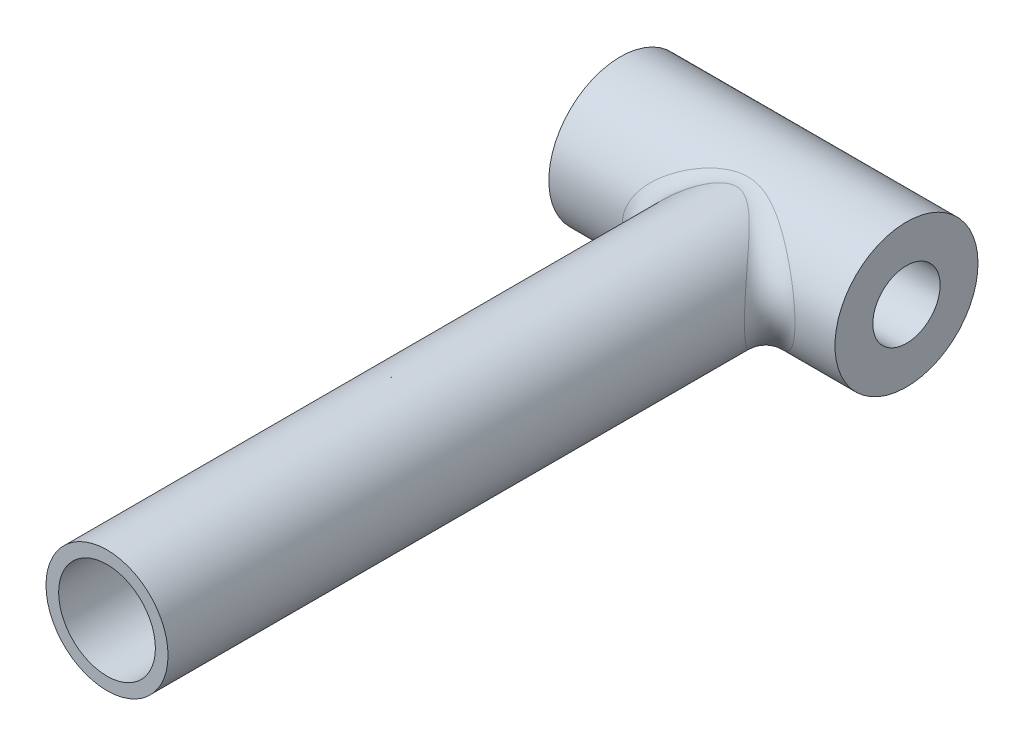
ISO-10303-21;
HEADER;
FILE_DESCRIPTION(('STEP AP214'),'2;1');
FILE_NAME('part.step','',(''),(''),'','','');
FILE_SCHEMA(('AUTOMOTIVE_DESIGN { 1 0 10303 214 1 1 1 1 }'));
ENDSEC;
DATA;
#1=APPLICATION_CONTEXT('core data for automotive mechanical design processes');
#2=APPLICATION_PROTOCOL_DEFINITION('international standard','automotive_design',2000,#1);
#3=PRODUCT_CONTEXT('',#1,'mechanical');
#4=PRODUCT('Part','Part','',(#3));
#5=PRODUCT_RELATED_PRODUCT_CATEGORY('part','',(#4));
#6=PRODUCT_DEFINITION_FORMATION('','',#4);
#7=PRODUCT_DEFINITION_CONTEXT('part definition',#1,'design');
#8=PRODUCT_DEFINITION('design','',#6,#7);
#9=PRODUCT_DEFINITION_SHAPE('','',#8);
#10=(LENGTH_UNIT() NAMED_UNIT(*) SI_UNIT(.MILLI.,.METRE.));
#11=(NAMED_UNIT(*) PLANE_ANGLE_UNIT() SI_UNIT($,.RADIAN.));
#12=(NAMED_UNIT(*) SI_UNIT($,.STERADIAN.) SOLID_ANGLE_UNIT());
#13=UNCERTAINTY_MEASURE_WITH_UNIT(LENGTH_MEASURE(1.E-05),#10,'distance_accuracy_value','');
#14=(GEOMETRIC_REPRESENTATION_CONTEXT(3) GLOBAL_UNCERTAINTY_ASSIGNED_CONTEXT((#13)) GLOBAL_UNIT_ASSIGNED_CONTEXT((#10,
#11,#12)) REPRESENTATION_CONTEXT('',''));
#15=CARTESIAN_POINT('',(0.,0.,0.));
#16=DIRECTION('',(0.,0.,1.));
#17=DIRECTION('',(1.,0.,0.));
#18=AXIS2_PLACEMENT_3D('',#15,#16,#17);
#19=CARTESIAN_POINT('',(0.,0.,80.));
#20=DIRECTION('',(0.,0.,1.));
#21=DIRECTION('',(1.,0.,0.));
#22=AXIS2_PLACEMENT_3D('',#19,#20,#21);
#23=PLANE('',#22);
#24=CARTESIAN_POINT('',(0.,0.,80.));
#25=DIRECTION('',(0.,0.,1.));
#26=DIRECTION('',(1.,0.,0.));
#27=AXIS2_PLACEMENT_3D('',#24,#25,#26);
#28=CIRCLE('',#27,7.25);
#29=CARTESIAN_POINT('',(7.25,0.,80.));
#30=VERTEX_POINT('',#29);
#31=EDGE_CURVE('E46',#30,#30,#28,.T.);
#32=ORIENTED_EDGE('',*,*,#31,.T.);
#33=EDGE_LOOP('',(#32));
#34=FACE_BOUND('',#33,.T.);
#35=CARTESIAN_POINT('',(0.,0.,80.));
#36=DIRECTION('',(0.,0.,1.));
#37=DIRECTION('',(1.,0.,0.));
#38=AXIS2_PLACEMENT_3D('',#35,#36,#37);
#39=CIRCLE('',#38,5.75);
#40=CARTESIAN_POINT('',(5.75,0.,80.));
#41=VERTEX_POINT('',#40);
#42=EDGE_CURVE('E90',#41,#41,#39,.T.);
#43=ORIENTED_EDGE('',*,*,#42,.F.);
#44=EDGE_LOOP('',(#43));
#45=FACE_BOUND('',#44,.T.);
#46=ADVANCED_FACE('F32',(#34,#45),#23,.T.);
#47=CARTESIAN_POINT('',(0.,0.,80.));
#48=DIRECTION('',(0.,0.,-1.));
#49=DIRECTION('',(-1.,0.,0.));
#50=AXIS2_PLACEMENT_3D('',#47,#48,#49);
#51=CYLINDRICAL_SURFACE('',#50,7.25);
#52=CARTESIAN_POINT('',(-7.04159736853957,1.72580604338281,11.2381817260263));
#53=CARTESIAN_POINT('',(-7.18168194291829,1.15423592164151,8.4474289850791));
#54=CARTESIAN_POINT('',(-9.95536179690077,1.80342850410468,8.30648214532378));
#55=CARTESIAN_POINT('',(-7.08243744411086,1.55917314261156,11.2893303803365));
#56=CARTESIAN_POINT('',(-7.19766176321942,1.0302742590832,8.46002891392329));
#57=CARTESIAN_POINT('',(-10.0131012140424,1.6293008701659,8.34428767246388));
#58=CARTESIAN_POINT('',(-7.11760454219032,1.39006723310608,11.3334678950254));
#59=CARTESIAN_POINT('',(-7.20992413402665,0.910144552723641,8.46956138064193));
#60=CARTESIAN_POINT('',(-10.0628202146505,1.45258899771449,8.37691105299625));
#61=CARTESIAN_POINT('',(-7.17592401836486,1.04817830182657,11.4067384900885));
#62=CARTESIAN_POINT('',(-7.22906823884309,0.67493640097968,8.48430011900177));
#63=CARTESIAN_POINT('',(-10.1452718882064,1.09532275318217,8.43106757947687));
#64=CARTESIAN_POINT('',(-7.19907641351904,0.875395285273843,11.4358715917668));
#65=CARTESIAN_POINT('',(-7.23588675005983,0.560211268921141,8.48945644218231));
#66=CARTESIAN_POINT('',(-10.1780045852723,0.914768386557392,8.45260074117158));
#67=CARTESIAN_POINT('',(-7.23287616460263,0.527724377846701,11.478422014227));
#68=CARTESIAN_POINT('',(-7.24551415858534,0.33404102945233,8.49668676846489));
#69=CARTESIAN_POINT('',(-10.2257904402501,0.551460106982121,8.48405105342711));
#70=CARTESIAN_POINT('',(-7.24352922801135,0.352837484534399,11.4918465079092));
#71=CARTESIAN_POINT('',(-7.24829401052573,0.22294595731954,8.49873869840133));
#72=CARTESIAN_POINT('',(-10.2408516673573,0.3687072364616,8.49397350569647));
#73=CARTESIAN_POINT('',(-7.25211586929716,0.0025119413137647,11.5026659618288));
#74=CARTESIAN_POINT('',(-7.250561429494,0.00137700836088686,8.50041553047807));
#75=CARTESIAN_POINT('',(-10.2529914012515,0.00262492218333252,8.50197049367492));
#76=CARTESIAN_POINT('',(-7.25005069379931,-0.172926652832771,11.500062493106));
#77=CARTESIAN_POINT('',(-7.25004229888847,-0.108749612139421,8.50003548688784));
#78=CARTESIAN_POINT('',(-10.2500716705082,-0.18070446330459,8.5000461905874));
#79=CARTESIAN_POINT('',(-7.23420803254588,-0.502825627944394,11.4801038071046));
#80=CARTESIAN_POINT('',(-7.24579106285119,-0.318589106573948,8.49688093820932));
#81=CARTESIAN_POINT('',(-10.2276734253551,-0.525441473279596,8.48529411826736));
#82=CARTESIAN_POINT('',(-7.22178703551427,-0.657406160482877,11.4644571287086));
#83=CARTESIAN_POINT('',(-7.24244111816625,-0.417784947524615,8.49439113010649));
#84=CARTESIAN_POINT('',(-10.2101127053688,-0.686974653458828,8.47372918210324));
#85=CARTESIAN_POINT('',(-7.18720073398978,-0.964651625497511,11.4209309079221));
#86=CARTESIAN_POINT('',(-7.23233690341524,-0.61961379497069,8.48676636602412));
#87=CARTESIAN_POINT('',(-10.1612148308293,-1.00803925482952,8.44155762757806));
#88=CARTESIAN_POINT('',(-7.16503222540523,-1.11731591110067,11.3930473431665));
#89=CARTESIAN_POINT('',(-7.2256072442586,-0.722002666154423,8.48165027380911));
#90=CARTESIAN_POINT('',(-10.1298731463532,-1.16757000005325,8.42094803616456));
#91=CARTESIAN_POINT('',(-7.11131139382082,-1.41961390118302,11.3255711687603));
#92=CARTESIAN_POINT('',(-7.20769081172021,-0.931336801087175,8.4678220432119));
#93=CARTESIAN_POINT('',(-10.0539230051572,-1.48346460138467,8.37107434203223));
#94=CARTESIAN_POINT('',(-7.07976210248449,-1.56924856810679,11.285982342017));
#95=CARTESIAN_POINT('',(-7.19655204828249,-1.03803499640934,8.45914798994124));
#96=CARTESIAN_POINT('',(-10.0093188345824,-1.6398294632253,8.34181303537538));
#97=CARTESIAN_POINT('',(-7.00775358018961,-1.8646853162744,11.1957928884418));
#98=CARTESIAN_POINT('',(-7.1686061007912,-1.25646162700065,8.4371243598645));
#99=CARTESIAN_POINT('',(-9.90751368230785,-1.94855422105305,8.27515126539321));
#100=CARTESIAN_POINT('',(-6.96729079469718,-2.01048584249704,11.1451878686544));
#101=CARTESIAN_POINT('',(-7.1518675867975,-1.3679568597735,8.4238305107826));
#102=CARTESIAN_POINT('',(-9.85030767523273,-2.100912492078,8.23774755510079));
#103=CARTESIAN_POINT('',(-6.83161540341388,-2.44645309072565,10.9758925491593));
#104=CARTESIAN_POINT('',(-7.0907830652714,-1.71257788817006,8.37487955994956));
#105=CARTESIAN_POINT('',(-9.65849074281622,-2.55648846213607,8.11261623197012));
#106=CARTESIAN_POINT('',(-6.72314221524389,-2.72952434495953,10.8410201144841));
#107=CARTESIAN_POINT('',(-7.03580185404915,-1.95409435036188,8.33033740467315));
#108=CARTESIAN_POINT('',(-9.50513209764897,-2.85229155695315,8.01292791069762));
#109=CARTESIAN_POINT('',(-6.47652241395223,-3.27204661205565,10.5366579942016));
#110=CARTESIAN_POINT('',(-6.88914161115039,-2.4502430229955,8.21072461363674));
#111=CARTESIAN_POINT('',(-9.15646272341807,-3.41921512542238,7.78796460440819));
#112=CARTESIAN_POINT('',(-6.33836323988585,-3.53148755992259,10.367153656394));
#113=CARTESIAN_POINT('',(-6.7985570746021,-2.70372200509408,8.13656036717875));
#114=CARTESIAN_POINT('',(-8.96113423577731,-3.69032508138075,7.66267878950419));
#115=CARTESIAN_POINT('',(-5.96320395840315,-4.14583856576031,9.91150481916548));
#116=CARTESIAN_POINT('',(-6.52518634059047,-3.33242898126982,7.91326984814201));
#117=CARTESIAN_POINT('',(-8.43073663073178,-4.33230806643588,7.32589486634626));
#118=CARTESIAN_POINT('',(-5.71089819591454,-4.48543538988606,9.60884286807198));
#119=CARTESIAN_POINT('',(-6.31955661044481,-3.71141958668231,7.74567322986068));
#120=CARTESIAN_POINT('',(-8.07402848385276,-4.68717911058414,7.10218820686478));
#121=CARTESIAN_POINT('',(-5.29985002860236,-4.95149681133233,9.12793660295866));
#122=CARTESIAN_POINT('',(-5.94585977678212,-4.26007218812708,7.44758092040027));
#123=CARTESIAN_POINT('',(-7.49289141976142,-5.17420281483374,6.74673574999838));
#124=CARTESIAN_POINT('',(-5.15710688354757,-5.09986324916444,8.96281722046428));
#125=CARTESIAN_POINT('',(-5.81227168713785,-4.43783328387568,7.34187015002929));
#126=CARTESIAN_POINT('',(-7.29108214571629,-5.32924240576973,6.62469098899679));
#127=CARTESIAN_POINT('',(-4.86152546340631,-5.3823600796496,8.6262884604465));
#128=CARTESIAN_POINT('',(-5.52620133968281,-4.78231262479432,7.11879301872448));
#129=CARTESIAN_POINT('',(-6.87319117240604,-5.62444524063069,6.37595234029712));
#130=CARTESIAN_POINT('',(-4.70868874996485,-5.51649266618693,8.45488005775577));
#131=CARTESIAN_POINT('',(-5.37393096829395,-4.94934993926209,7.00153958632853));
#132=CARTESIAN_POINT('',(-6.65711168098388,-5.76461077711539,6.24925917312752));
#133=CARTESIAN_POINT('',(-4.39003237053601,-5.77347172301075,8.10486035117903));
#134=CARTESIAN_POINT('',(-5.04813795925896,-5.2736196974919,6.75565099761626));
#135=CARTESIAN_POINT('',(-6.20659748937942,-6.03314811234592,5.99054895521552));
#136=CARTESIAN_POINT('',(-4.22399952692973,-5.89600075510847,7.92617363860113));
#137=CARTESIAN_POINT('',(-4.87427154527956,-5.43100631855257,6.62678466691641));
#138=CARTESIAN_POINT('',(-5.97186140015,-6.16118819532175,5.85847616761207));
#139=CARTESIAN_POINT('',(-3.88209473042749,-6.12652958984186,7.56864473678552));
#140=CARTESIAN_POINT('',(-4.5088976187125,-5.73008243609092,6.36359121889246));
#141=CARTESIAN_POINT('',(-5.48847875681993,-6.40208564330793,5.59421567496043));
#142=CARTESIAN_POINT('',(-3.70621951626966,-6.23452453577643,7.38980251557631));
#143=CARTESIAN_POINT('',(-4.31739704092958,-5.87218944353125,6.22916733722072));
#144=CARTESIAN_POINT('',(-5.23982759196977,-6.51493793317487,5.46202794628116));
#145=CARTESIAN_POINT('',(-3.34469103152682,-6.43570279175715,7.03661647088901));
#146=CARTESIAN_POINT('',(-3.91759136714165,-6.13882135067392,5.95958849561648));
#147=CARTESIAN_POINT('',(-4.72870111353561,-6.72516468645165,5.200977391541));
#148=CARTESIAN_POINT('',(-3.1590593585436,-6.52891712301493,6.86226388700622));
#149=CARTESIAN_POINT('',(-3.70925046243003,-6.26379544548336,5.8242527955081));
#150=CARTESIAN_POINT('',(-4.46625633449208,-6.82257156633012,5.0721080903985));
#151=CARTESIAN_POINT('',(-2.77683018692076,-6.70041450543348,6.52346258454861));
#152=CARTESIAN_POINT('',(-3.27520732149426,-6.49485199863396,5.55831572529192));
#153=CARTESIAN_POINT('',(-3.92586336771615,-7.00178247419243,4.82168973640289));
#154=CARTESIAN_POINT('',(-2.58024152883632,-6.77870937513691,6.35900609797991));
#155=CARTESIAN_POINT('',(-3.0493542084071,-6.60134407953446,5.42744198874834));
#156=CARTESIAN_POINT('',(-3.64792767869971,-7.08359885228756,4.70013494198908));
#157=CARTESIAN_POINT('',(-2.1793395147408,-6.91787455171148,6.05188681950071));
#158=CARTESIAN_POINT('',(-2.58476093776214,-6.79121043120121,5.18114062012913));
#159=CARTESIAN_POINT('',(-3.08113517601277,-7.22902333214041,4.47313373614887));
#160=CARTESIAN_POINT('',(-1.97532072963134,-6.97911470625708,5.90879901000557));
#161=CARTESIAN_POINT('',(-2.34624722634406,-6.87540041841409,5.06512017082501));
#162=CARTESIAN_POINT('',(-2.79269482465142,-7.29301791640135,4.36737318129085));
#163=CARTESIAN_POINT('',(-1.55398086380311,-7.08481187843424,5.65178605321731));
#164=CARTESIAN_POINT('',(-1.85080976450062,-7.02088239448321,4.85582092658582));
#165=CARTESIAN_POINT('',(-2.19700742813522,-7.40346908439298,4.17740708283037));
#166=CARTESIAN_POINT('',(-1.33668190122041,-7.12929596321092,5.53781397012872));
#167=CARTESIAN_POINT('',(-1.59353586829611,-7.08251529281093,4.76213748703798));
#168=CARTESIAN_POINT('',(-1.88979165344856,-7.44995395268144,4.09316684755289));
#169=CARTESIAN_POINT('',(-1.01928651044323,-7.17862226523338,5.40813934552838));
#170=CARTESIAN_POINT('',(-1.2161246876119,-7.15091329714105,4.65527851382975));
#171=CARTESIAN_POINT('',(-1.44106023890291,-7.50149882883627,3.99732038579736));
#172=CARTESIAN_POINT('',(-0.924204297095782,-7.19150185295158,5.37375361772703));
#173=CARTESIAN_POINT('',(-1.10300008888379,-7.16877578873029,4.62691342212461));
#174=CARTESIAN_POINT('',(-1.30663366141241,-7.51495770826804,3.97190484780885));
#175=CARTESIAN_POINT('',(-0.732196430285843,-7.21357838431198,5.31428008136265));
#176=CARTESIAN_POINT('',(-0.874330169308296,-7.19939853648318,4.57782176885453));
#177=CARTESIAN_POINT('',(-1.03517426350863,-7.53802718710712,3.92794614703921));
#178=CARTESIAN_POINT('',(-0.635271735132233,-7.22277719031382,5.28918757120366));
#179=CARTESIAN_POINT('',(-0.758735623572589,-7.2121758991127,4.55706883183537));
#180=CARTESIAN_POINT('',(-0.898142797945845,-7.54763973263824,3.90939950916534));
#181=CARTESIAN_POINT('',(-0.440209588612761,-7.2372829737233,5.24940553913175));
#182=CARTESIAN_POINT('',(-0.525969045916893,-7.23232173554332,4.52416235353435));
#183=CARTESIAN_POINT('',(-0.62236528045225,-7.56279795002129,3.87999539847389));
#184=CARTESIAN_POINT('',(-0.342074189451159,-7.24259580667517,5.23470036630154));
#185=CARTESIAN_POINT('',(-0.4087431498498,-7.23970844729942,4.51197959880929));
#186=CARTESIAN_POINT('',(-0.483622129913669,-7.56834974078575,3.86912635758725));
#187=CARTESIAN_POINT('',(-0.145146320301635,-7.24921623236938,5.21635151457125));
#188=CARTESIAN_POINT('',(-0.173482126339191,-7.24890921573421,4.49678373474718));
#189=CARTESIAN_POINT('',(-0.20520686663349,-7.57526793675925,3.85556416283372));
#190=CARTESIAN_POINT('',(-0.0463538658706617,-7.25052391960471,5.21270757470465));
#191=CARTESIAN_POINT('',(-0.0553861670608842,-7.25072819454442,4.49376251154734));
#192=CARTESIAN_POINT('',(-0.0655347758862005,-7.57663444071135,3.85287081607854));
#193=CARTESIAN_POINT('',(0.151248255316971,-7.2490966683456,5.21667364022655));
#194=CARTESIAN_POINT('',(0.180745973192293,-7.24874432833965,4.49704803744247));
#195=CARTESIAN_POINT('',(0.21383374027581,-7.57514299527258,3.85580225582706));
#196=CARTESIAN_POINT('',(0.250057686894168,-7.24635512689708,5.2243020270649));
#197=CARTESIAN_POINT('',(0.298843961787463,-7.24493125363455,4.50337175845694));
#198=CARTESIAN_POINT('',(0.353529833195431,-7.57227814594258,3.86144062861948));
#199=CARTESIAN_POINT('',(0.446751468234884,-7.23689233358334,5.25045375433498));
#200=CARTESIAN_POINT('',(0.533753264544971,-7.23178268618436,4.52502267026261));
#201=CARTESIAN_POINT('',(0.631614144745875,-7.56238973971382,3.88077016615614));
#202=CARTESIAN_POINT('',(0.544635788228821,-7.23017095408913,5.26897744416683));
#203=CARTESIAN_POINT('',(0.650624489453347,-7.2224402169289,4.54036129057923));
#204=CARTESIAN_POINT('',(0.770002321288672,-7.55536604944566,3.89446158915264));
#205=CARTESIAN_POINT('',(0.738998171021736,-7.21289949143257,5.31608150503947));
#206=CARTESIAN_POINT('',(0.882414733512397,-7.19846233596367,4.57929918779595));
#207=CARTESIAN_POINT('',(1.04479051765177,-7.53731775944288,3.92927763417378));
#208=CARTESIAN_POINT('',(0.835473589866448,-7.20234298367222,5.34467874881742));
#209=CARTESIAN_POINT('',(0.997384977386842,-7.18380617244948,4.60293122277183));
#210=CARTESIAN_POINT('',(1.18118679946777,-7.52628644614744,3.95041472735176));
#211=CARTESIAN_POINT('',(1.0264330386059,-7.17761889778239,5.41075106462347));
#212=CARTESIAN_POINT('',(1.22459684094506,-7.14952954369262,4.65741704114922));
#213=CARTESIAN_POINT('',(1.45116395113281,-7.50045033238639,3.99925078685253));
#214=CARTESIAN_POINT('',(1.12091629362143,-7.16344994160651,5.44822952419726));
#215=CARTESIAN_POINT('',(1.33688574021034,-7.12989123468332,4.68829785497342));
#216=CARTESIAN_POINT('',(1.58474372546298,-7.48564409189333,4.02695225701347));
#217=CARTESIAN_POINT('',(1.36022819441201,-7.12279403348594,5.55403553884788));
#218=CARTESIAN_POINT('',(1.62090444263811,-7.07360024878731,4.77531287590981));
#219=CARTESIAN_POINT('',(1.92308124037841,-7.44315958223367,4.10515670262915));
#220=CARTESIAN_POINT('',(1.50343235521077,-7.09386451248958,5.62784743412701));
#221=CARTESIAN_POINT('',(1.79035473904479,-7.03358556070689,4.835880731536));
#222=CARTESIAN_POINT('',(2.12554229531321,-7.41292888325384,4.1597133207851));
#223=CARTESIAN_POINT('',(1.78409486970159,-7.02853488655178,5.78936848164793));
#224=CARTESIAN_POINT('',(2.12110378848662,-6.9435423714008,4.96772952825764));
#225=CARTESIAN_POINT('',(2.52234102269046,-7.34466089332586,4.27909844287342));
#226=CARTESIAN_POINT('',(1.92154931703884,-6.99212979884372,5.87708689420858));
#227=CARTESIAN_POINT('',(2.28251684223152,-6.89342241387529,5.03912490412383));
#228=CARTESIAN_POINT('',(2.71667317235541,-7.30661839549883,4.34393379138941));
#229=CARTESIAN_POINT('',(2.19138459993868,-6.91232181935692,6.0628601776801));
#230=CARTESIAN_POINT('',(2.59781436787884,-6.7839914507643,5.1894156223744));
#231=CARTESIAN_POINT('',(3.09816443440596,-7.22322085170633,4.48124447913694));
#232=CARTESIAN_POINT('',(2.32374684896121,-6.86889584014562,6.160948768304));
#233=CARTESIAN_POINT('',(2.75176099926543,-6.72455738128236,5.26843593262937));
#234=CARTESIAN_POINT('',(3.2852972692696,-7.17784167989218,4.55374474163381));
#235=CARTESIAN_POINT('',(2.58335322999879,-6.77553045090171,6.36425104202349));
#236=CARTESIAN_POINT('',(3.05190649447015,-6.59736809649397,5.43107625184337));
#237=CARTESIAN_POINT('',(3.65232698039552,-7.08027694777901,4.70401163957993));
#238=CARTESIAN_POINT('',(2.71059556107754,-6.72558877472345,6.46946719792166));
#239=CARTESIAN_POINT('',(3.19817143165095,-6.52951029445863,5.51478861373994));
#240=CARTESIAN_POINT('',(3.83222131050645,-7.02808901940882,4.78178010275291));
#241=CARTESIAN_POINT('',(3.05266110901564,-6.58023655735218,6.76419401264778));
#242=CARTESIAN_POINT('',(3.58958681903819,-6.3325566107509,5.74796720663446));
#243=CARTESIAN_POINT('',(4.31583122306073,-6.8761992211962,4.99962166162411));
#244=CARTESIAN_POINT('',(3.2627303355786,-6.47849493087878,6.95854708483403));
#245=CARTESIAN_POINT('',(3.82644075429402,-6.19568330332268,5.89961670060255));
#246=CARTESIAN_POINT('',(4.61282564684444,-6.76988150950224,5.14327393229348));
#247=CARTESIAN_POINT('',(3.67016678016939,-6.25669009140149,7.3530905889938));
#248=CARTESIAN_POINT('',(4.27847264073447,-5.90112472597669,6.20179593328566));
#249=CARTESIAN_POINT('',(5.18885648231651,-6.53810044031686,5.43489304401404));
#250=CARTESIAN_POINT('',(3.86752548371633,-6.13661477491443,7.55328480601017));
#251=CARTESIAN_POINT('',(4.4937558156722,-5.74284383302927,6.35259771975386));
#252=CARTESIAN_POINT('',(5.4678808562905,-6.41262443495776,5.58286268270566));
#253=CARTESIAN_POINT('',(4.24986903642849,-5.87828873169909,7.95335370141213));
#254=CARTESIAN_POINT('',(4.90215784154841,-5.40779613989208,6.64696237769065));
#255=CARTESIAN_POINT('',(6.00843553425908,-6.14267952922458,5.87856577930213));
#256=CARTESIAN_POINT('',(4.43486358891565,-5.7400525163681,8.15322850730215));
#257=CARTESIAN_POINT('',(5.09527723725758,-5.23045016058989,6.79066352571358));
#258=CARTESIAN_POINT('',(6.26997955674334,-5.99822579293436,6.0262993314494));
#259=CARTESIAN_POINT('',(4.79226534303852,-5.4452097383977,8.54792654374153));
#260=CARTESIAN_POINT('',(5.45839645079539,-4.85984810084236,7.06610714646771));
#261=CARTESIAN_POINT('',(6.77527169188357,-5.69012172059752,6.3180326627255));
#262=CARTESIAN_POINT('',(4.96467814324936,-5.28861142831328,8.74275199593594));
#263=CARTESIAN_POINT('',(5.62822845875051,-4.66604617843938,7.19782359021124));
#264=CARTESIAN_POINT('',(7.01902771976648,-5.52648000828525,6.46203408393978));
#265=CARTESIAN_POINT('',(5.39386978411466,-4.85878740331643,9.23542193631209));
#266=CARTESIAN_POINT('',(6.03854918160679,-4.14462306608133,7.52003897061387));
#267=CARTESIAN_POINT('',(7.62581590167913,-5.07732356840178,6.82618143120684));
#268=CARTESIAN_POINT('',(5.64053022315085,-4.57119331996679,9.52635945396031));
#269=CARTESIAN_POINT('',(6.25674665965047,-3.80876938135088,7.69577100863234));
#270=CARTESIAN_POINT('',(7.97454272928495,-4.77679421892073,7.04122220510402));
#271=CARTESIAN_POINT('',(6.09278908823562,-3.94815051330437,10.0677178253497));
#272=CARTESIAN_POINT('',(6.62527671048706,-3.12549124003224,7.99462494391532));
#273=CARTESIAN_POINT('',(8.61394319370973,-4.12572849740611,7.44135665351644));
#274=CARTESIAN_POINT('',(6.29843353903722,-3.61275616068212,10.3181840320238));
#275=CARTESIAN_POINT('',(6.77322022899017,-2.7777663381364,8.11589291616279));
#276=CARTESIAN_POINT('',(8.9046819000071,-3.77524894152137,7.62648384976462));
#277=CARTESIAN_POINT('',(6.55965004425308,-3.09299424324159,10.6391337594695));
#278=CARTESIAN_POINT('',(6.93903835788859,-2.28691211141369,8.25144181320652));
#279=CARTESIAN_POINT('',(9.27398799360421,-3.23210942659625,7.8637075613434));
#280=CARTESIAN_POINT('',(6.63589553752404,-2.92603737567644,10.7332698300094));
#281=CARTESIAN_POINT('',(6.98409734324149,-2.13394997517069,8.28820373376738));
#282=CARTESIAN_POINT('',(9.38178334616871,-3.05764325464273,7.93328639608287));
#283=CARTESIAN_POINT('',(6.7765142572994,-2.58370522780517,10.9074688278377));
#284=CARTESIAN_POINT('',(7.06166291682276,-1.83322986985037,8.35125529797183));
#285=CARTESIAN_POINT('',(9.58058912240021,-2.69991385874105,8.06204217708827));
#286=CARTESIAN_POINT('',(6.8408942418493,-2.40833481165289,10.9875397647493));
#287=CARTESIAN_POINT('',(7.09393282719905,-1.68579065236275,8.37734884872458));
#288=CARTESIAN_POINT('',(9.67160910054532,-2.51665571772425,8.12122504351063));
#289=CARTESIAN_POINT('',(6.95656885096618,-2.05036592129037,11.1317643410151));
#290=CARTESIAN_POINT('',(7.14762626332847,-1.39789398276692,8.42047007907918));
#291=CARTESIAN_POINT('',(9.83514906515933,-2.14258627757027,8.22782581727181));
#292=CARTESIAN_POINT('',(7.0078775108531,-1.86777544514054,11.1959350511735));
#293=CARTESIAN_POINT('',(7.16886417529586,-1.25784193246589,8.43734459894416));
#294=CARTESIAN_POINT('',(9.90768889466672,-1.95178333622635,8.27525634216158));
#295=CARTESIAN_POINT('',(7.09640571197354,-1.49662565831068,11.3068441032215));
#296=CARTESIAN_POINT('',(7.20282026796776,-0.984896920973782,8.46406742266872));
#297=CARTESIAN_POINT('',(10.0328494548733,-1.56394015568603,8.35723259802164));
#298=CARTESIAN_POINT('',(7.13362861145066,-1.30806778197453,11.3535866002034));
#299=CARTESIAN_POINT('',(7.21540449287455,-0.852470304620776,8.47380710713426));
#300=CARTESIAN_POINT('',(10.0854749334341,-1.36690141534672,8.3917814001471));
#301=CARTESIAN_POINT('',(7.18763944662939,-0.961850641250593,11.4214775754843));
#302=CARTESIAN_POINT('',(7.23256901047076,-0.617454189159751,8.48695459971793));
#303=CARTESIAN_POINT('',(10.1618350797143,-1.00511228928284,8.44196168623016));
#304=CARTESIAN_POINT('',(7.20692569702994,-0.804881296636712,11.4457509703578));
#305=CARTESIAN_POINT('',(7.23815725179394,-0.514023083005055,8.49116714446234));
#306=CARTESIAN_POINT('',(10.1891018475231,-0.841082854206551,8.45990289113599));
#307=CARTESIAN_POINT('',(7.23520387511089,-0.489295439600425,11.4813553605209));
#308=CARTESIAN_POINT('',(7.24611867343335,-0.309630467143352,8.49713261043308));
#309=CARTESIAN_POINT('',(10.229081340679,-0.511302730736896,8.48621917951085));
#310=CARTESIAN_POINT('',(7.24419717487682,-0.330679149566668,11.492688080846));
#311=CARTESIAN_POINT('',(7.24847134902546,-0.208930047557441,8.49886999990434));
#312=CARTESIAN_POINT('',(10.2417960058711,-0.345552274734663,8.49459553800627));
#313=CARTESIAN_POINT('',(7.25172833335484,-0.0130411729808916,11.5021777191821));
#314=CARTESIAN_POINT('',(7.2504577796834,-0.00806260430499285,8.50033871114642));
#315=CARTESIAN_POINT('',(10.252443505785,-0.0136277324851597,8.50160961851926));
#316=CARTESIAN_POINT('',(7.25026873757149,0.145980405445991,11.5003378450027));
#317=CARTESIAN_POINT('',(7.25008712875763,0.091845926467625,8.50006677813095));
#318=CARTESIAN_POINT('',(10.2503799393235,0.152546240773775,8.50024971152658));
#319=CARTESIAN_POINT('',(7.23692733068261,0.463240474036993,11.4835291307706));
#320=CARTESIAN_POINT('',(7.24652910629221,0.293269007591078,8.49742993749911));
#321=CARTESIAN_POINT('',(10.2315179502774,0.484075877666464,8.48782587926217));
#322=CARTESIAN_POINT('',(7.22504515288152,0.621478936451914,11.4685598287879));
#323=CARTESIAN_POINT('',(7.24335076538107,0.394524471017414,8.49507173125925));
#324=CARTESIAN_POINT('',(10.214719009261,0.649431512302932,8.47676161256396));
#325=CARTESIAN_POINT('',(7.19110555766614,0.935633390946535,11.4258431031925));
#326=CARTESIAN_POINT('',(7.23351073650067,0.600276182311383,8.48765680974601));
#327=CARTESIAN_POINT('',(10.1667354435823,0.977715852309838,8.4451883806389));
#328=CARTESIAN_POINT('',(7.16907015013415,1.09155365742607,11.398123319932));
#329=CARTESIAN_POINT('',(7.22688263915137,0.704503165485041,8.48262586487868));
#330=CARTESIAN_POINT('',(10.1355819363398,1.14064902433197,8.42469984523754));
#331=CARTESIAN_POINT('',(7.11519443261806,1.40039043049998,11.3304448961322));
#332=CARTESIAN_POINT('',(7.20904690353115,0.917717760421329,8.4688761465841));
#333=CARTESIAN_POINT('',(10.0594128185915,1.46337650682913,8.37467666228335));
#334=CARTESIAN_POINT('',(7.08335043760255,1.5533057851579,11.2904816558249));
#335=CARTESIAN_POINT('',(7.19788577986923,1.02644635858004,8.46019416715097));
#336=CARTESIAN_POINT('',(10.0143919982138,1.62316961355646,8.34513861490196));
#337=CARTESIAN_POINT('',(7.01035418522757,1.85513814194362,11.199045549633));
#338=CARTESIAN_POINT('',(7.16967213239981,1.24919024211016,8.43796898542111));
#339=CARTESIAN_POINT('',(9.91119040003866,1.9385776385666,8.27755540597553));
#340=CARTESIAN_POINT('',(6.96920171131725,2.00405505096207,11.1475724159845));
#341=CARTESIAN_POINT('',(7.15269442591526,1.36295363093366,8.42448653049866));
#342=CARTESIAN_POINT('',(9.85300931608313,2.09419245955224,8.23951004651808));
#343=CARTESIAN_POINT('',(6.8781712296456,2.29713811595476,11.033984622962));
#344=CARTESIAN_POINT('',(7.11158617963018,1.59553946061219,8.39155672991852));
#345=CARTESIAN_POINT('',(9.72431104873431,2.40045767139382,8.15555385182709));
#346=CARTESIAN_POINT('',(6.82828982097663,2.44130239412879,10.9718658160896));
#347=CARTESIAN_POINT('',(7.08755456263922,1.71413601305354,8.37219084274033));
#348=CARTESIAN_POINT('',(9.65378905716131,2.55110609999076,8.10963995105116));
#349=CARTESIAN_POINT('',(6.66342788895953,2.873673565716,10.7671524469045));
#350=CARTESIAN_POINT('',(7.00190175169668,2.08119719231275,8.30277299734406));
#351=CARTESIAN_POINT('',(9.42070839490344,3.00292425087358,7.95833006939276));
#352=CARTESIAN_POINT('',(6.53530903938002,3.15329930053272,10.6088234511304));
#353=CARTESIAN_POINT('',(6.92716266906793,2.33778568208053,8.24174856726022));
#354=CARTESIAN_POINT('',(9.23957484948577,3.29512685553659,7.84130428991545));
#355=CARTESIAN_POINT('',(6.25031955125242,3.68612330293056,10.2598185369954));
#356=CARTESIAN_POINT('',(6.73644749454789,2.85822371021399,8.08581679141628));
#357=CARTESIAN_POINT('',(8.83665867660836,3.85191595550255,7.58334413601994));
#358=CARTESIAN_POINT('',(6.0934484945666,3.93932118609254,10.0691421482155));
#359=CARTESIAN_POINT('',(6.62173398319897,3.12127051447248,7.99194594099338));
#360=CARTESIAN_POINT('',(8.61487545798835,4.11650204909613,7.44240941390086));
#361=CARTESIAN_POINT('',(5.79519606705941,4.36217487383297,9.71117105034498));
#362=CARTESIAN_POINT('',(6.38202266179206,3.58187234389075,7.79726584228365));
#363=CARTESIAN_POINT('',(8.19320823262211,4.55837464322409,7.17782208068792));
#364=CARTESIAN_POINT('',(5.6587799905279,4.53751527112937,9.54884598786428));
#365=CARTESIAN_POINT('',(6.26685285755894,3.77929099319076,7.70412741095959));
#366=CARTESIAN_POINT('',(8.0003441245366,4.7416014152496,7.05784268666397));
#367=CARTESIAN_POINT('',(5.37340305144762,4.87210413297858,9.21344080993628));
#368=CARTESIAN_POINT('',(6.01363876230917,4.16589492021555,7.50138422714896));
#369=CARTESIAN_POINT('',(7.59688017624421,5.09123925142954,6.8099345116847));
#370=CARTESIAN_POINT('',(5.2244409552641,5.03135101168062,9.0403596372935));
#371=CARTESIAN_POINT('',(5.87598106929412,4.35530759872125,7.39205398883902));
#372=CARTESIAN_POINT('',(7.386278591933,5.25764865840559,6.68200494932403));
#373=CARTESIAN_POINT('',(4.91444904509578,5.33459857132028,8.68594703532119));
#374=CARTESIAN_POINT('',(5.57862740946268,4.72303954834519,7.15933902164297));
#375=CARTESIAN_POINT('',(6.94801416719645,5.57453553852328,6.42004780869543));
#376=CARTESIAN_POINT('',(4.75336473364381,5.47852239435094,8.5045799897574));
#377=CARTESIAN_POINT('',(5.41907946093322,4.9016874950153,7.03602752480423));
#378=CARTESIAN_POINT('',(6.72027427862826,5.7249326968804,6.28599390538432));
#379=CARTESIAN_POINT('',(4.42052351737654,5.75044792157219,8.13784710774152));
#380=CARTESIAN_POINT('',(5.07997527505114,5.24409174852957,6.77935294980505));
#381=CARTESIAN_POINT('',(6.24970566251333,6.0090887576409,6.01493047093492));
#382=CARTESIAN_POINT('',(4.248769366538,5.87845370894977,7.95248231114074));
#383=CARTESIAN_POINT('',(4.90056092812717,5.40829593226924,6.64601148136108));
#384=CARTESIAN_POINT('',(6.00688082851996,6.14285192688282,5.8779217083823));
#385=CARTESIAN_POINT('',(3.89042950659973,6.12169085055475,7.57698402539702));
#386=CARTESIAN_POINT('',(4.5182372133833,5.72352041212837,6.37005504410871));
#387=CARTESIAN_POINT('',(5.50026240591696,6.39702926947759,5.60037949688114));
#388=CARTESIAN_POINT('',(3.70358478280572,6.23653612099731,7.38684413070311));
#389=CARTESIAN_POINT('',(4.31481078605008,5.87468289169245,6.22713393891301));
#390=CARTESIAN_POINT('',(5.23610262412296,6.51703999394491,5.45984131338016));
#391=CARTESIAN_POINT('',(3.31825146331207,6.4498272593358,7.01120227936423));
#392=CARTESIAN_POINT('',(3.88835118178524,6.15750387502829,5.94018119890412));
#393=CARTESIAN_POINT('',(4.69132103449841,6.73992443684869,5.18219298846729));
#394=CARTESIAN_POINT('',(3.11975310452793,6.54825910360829,6.82570440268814));
#395=CARTESIAN_POINT('',(3.66520163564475,6.28965016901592,5.79591864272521));
#396=CARTESIAN_POINT('',(4.41068542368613,6.84278350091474,5.04508586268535));
#397=CARTESIAN_POINT('',(2.71111756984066,6.72769466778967,6.46743968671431));
#398=CARTESIAN_POINT('',(3.20017265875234,6.5317253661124,5.51406228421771));
#399=CARTESIAN_POINT('',(3.83295932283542,7.03028963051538,4.78028150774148));
#400=CARTESIAN_POINT('',(2.50105297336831,6.80879428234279,6.29460646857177));
#401=CARTESIAN_POINT('',(2.95821380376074,6.64223827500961,5.3761144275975));
#402=CARTESIAN_POINT('',(3.53597144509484,7.11503690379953,4.65253521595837));
#403=CARTESIAN_POINT('',(2.17541147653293,6.91687090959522,6.05226308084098));
#404=CARTESIAN_POINT('',(2.5790171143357,6.79025578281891,5.18080058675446));
#405=CARTESIAN_POINT('',(3.07558174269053,7.22797454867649,4.47341184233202));
#406=CARTESIAN_POINT('',(2.06518663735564,6.95061568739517,5.97434768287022));
#407=CARTESIAN_POINT('',(2.45038036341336,6.83652058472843,5.11781690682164));
#408=CARTESIAN_POINT('',(2.91974662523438,7.2632370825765,4.41582220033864));
#409=CARTESIAN_POINT('',(1.8409510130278,7.01334108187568,5.82597774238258));
#410=CARTESIAN_POINT('',(2.18774865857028,6.92265049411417,4.99748622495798));
#411=CARTESIAN_POINT('',(2.60272384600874,7.32878370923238,4.30615746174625));
#412=CARTESIAN_POINT('',(1.72694184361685,7.04232370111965,5.75552006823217));
#413=CARTESIAN_POINT('',(2.05370154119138,6.96256915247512,4.94007917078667));
#414=CARTESIAN_POINT('',(2.44153846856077,7.35906989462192,4.25408005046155));
#415=CARTESIAN_POINT('',(1.51468622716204,7.09069636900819,5.63540402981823));
#416=CARTESIAN_POINT('',(1.80335381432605,7.02928381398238,4.84194134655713));
#417=CARTESIAN_POINT('',(2.14145294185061,7.40961824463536,4.16529863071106));
#418=CARTESIAN_POINT('',(1.41704734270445,7.11087964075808,5.58424496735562));
#419=CARTESIAN_POINT('',(1.68791793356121,7.05717091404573,4.80001922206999));
#420=CARTESIAN_POINT('',(2.00341176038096,7.43070930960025,4.12748541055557));
#421=CARTESIAN_POINT('',(1.21911723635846,7.14747357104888,5.4900705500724));
#422=CARTESIAN_POINT('',(1.45346682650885,7.10776573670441,4.72272666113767));
#423=CARTESIAN_POINT('',(1.72357954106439,7.46894914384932,4.05787823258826));
#424=CARTESIAN_POINT('',(1.11882624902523,7.16388456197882,5.44705447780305));
#425=CARTESIAN_POINT('',(1.33440432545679,7.1304982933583,4.68732163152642));
#426=CARTESIAN_POINT('',(1.58178883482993,7.48609826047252,4.02608374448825));
#427=CARTESIAN_POINT('',(0.916117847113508,7.19261231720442,5.37085062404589));
#428=CARTESIAN_POINT('',(1.09341966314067,7.17030503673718,4.62453781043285));
#429=CARTESIAN_POINT('',(1.2952010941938,7.51611811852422,3.96975915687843));
#430=CARTESIAN_POINT('',(0.813707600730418,7.20494104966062,5.33763414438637));
#431=CARTESIAN_POINT('',(0.971451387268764,7.18741630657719,4.59710484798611));
#432=CARTESIAN_POINT('',(1.15041419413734,7.52900136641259,3.94520784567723));
#433=CARTESIAN_POINT('',(0.606976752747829,7.22529304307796,5.28236059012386));
#434=CARTESIAN_POINT('',(0.725025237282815,7.21566287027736,4.55143621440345));
#435=CARTESIAN_POINT('',(0.858139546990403,7.55026874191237,3.90435347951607));
#436=CARTESIAN_POINT('',(0.502656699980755,7.23331752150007,5.26030036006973));
#437=CARTESIAN_POINT('',(0.600503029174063,7.22681557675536,4.53317313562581));
#438=CARTESIAN_POINT('',(0.710652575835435,7.55865414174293,3.88804809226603));
#439=CARTESIAN_POINT('',(0.291692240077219,7.24490788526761,5.2283233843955));
#440=CARTESIAN_POINT('',(0.348597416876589,7.24291853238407,4.50670483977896));
#441=CARTESIAN_POINT('',(0.412392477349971,7.57076581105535,3.8644129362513));
#442=CARTESIAN_POINT('',(0.185034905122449,7.24842510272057,5.2185392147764));
#443=CARTESIAN_POINT('',(0.221122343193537,7.24781079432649,4.49859356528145));
#444=CARTESIAN_POINT('',(0.261601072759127,7.57444122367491,3.8571811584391));
#445=CARTESIAN_POINT('',(-0.0285258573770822,7.25073021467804,5.21213483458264));
#446=CARTESIAN_POINT('',(-0.0340758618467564,7.25101485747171,4.49328822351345));
#447=CARTESIAN_POINT('',(-0.0403296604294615,7.57685001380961,3.85244748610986));
#448=CARTESIAN_POINT('',(-0.135429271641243,7.24951835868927,5.21551392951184));
#449=CARTESIAN_POINT('',(-0.161877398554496,7.24932897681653,4.49609031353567));
#450=CARTESIAN_POINT('',(-0.191468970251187,7.57558365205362,3.85494507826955));
#451=CARTESIAN_POINT('',(-0.348630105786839,7.24239961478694,5.23524433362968));
#452=CARTESIAN_POINT('',(-0.416579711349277,7.23943560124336,4.51243036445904));
#453=CARTESIAN_POINT('',(-0.492890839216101,7.56814472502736,3.86952842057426));
#454=CARTESIAN_POINT('',(-0.454926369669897,7.23648565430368,5.25161518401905));
#455=CARTESIAN_POINT('',(-0.543556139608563,7.23121223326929,4.5259944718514));
#456=CARTESIAN_POINT('',(-0.643171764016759,7.5619647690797,3.8816286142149));
#457=CARTESIAN_POINT('',(-0.665880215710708,7.22013195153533,5.29641406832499));
#458=CARTESIAN_POINT('',(-0.795255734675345,7.20850194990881,4.56304571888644));
#459=CARTESIAN_POINT('',(-0.941416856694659,7.5448755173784,3.91474083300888));
#460=CARTESIAN_POINT('',(-0.77053747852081,7.20969133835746,5.32484442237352));
#461=CARTESIAN_POINT('',(-0.920049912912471,7.19400049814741,4.58655620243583));
#462=CARTESIAN_POINT('',(-1.08938057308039,7.53396531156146,3.93575457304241));
#463=CARTESIAN_POINT('',(-1.00269522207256,7.18149640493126,5.40053557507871));
#464=CARTESIAN_POINT('',(-1.19647769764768,7.15489148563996,4.64902090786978));
#465=CARTESIAN_POINT('',(-1.41760358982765,7.50450224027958,3.99170020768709));
#466=CARTESIAN_POINT('',(-1.12958038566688,7.16258246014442,5.4506909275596));
#467=CARTESIAN_POINT('',(-1.34732136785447,7.12866195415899,4.69037400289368));
#468=CARTESIAN_POINT('',(-1.59699295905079,7.48473759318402,4.02877155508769));
#469=CARTESIAN_POINT('',(-1.37930114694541,7.11871697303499,5.56436642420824));
#470=CARTESIAN_POINT('',(-1.64337335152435,7.06798211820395,4.78375563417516));
#471=CARTESIAN_POINT('',(-1.95004644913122,7.43889914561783,4.1127925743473));
#472=CARTESIAN_POINT('',(-1.50213292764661,7.09375991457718,5.62789877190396));
#473=CARTESIAN_POINT('',(-1.78867365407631,7.03347752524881,4.83586024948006));
#474=CARTESIAN_POINT('',(-2.12370517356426,7.4128195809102,4.1597512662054));
#475=CARTESIAN_POINT('',(-1.74389115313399,7.03823668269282,5.76555617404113));
#476=CARTESIAN_POINT('',(-2.07367929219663,6.95693253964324,4.94827339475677));
#477=CARTESIAN_POINT('',(-2.4655012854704,7.35479905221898,4.26149804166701));
#478=CARTESIAN_POINT('',(-1.86280475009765,7.00765387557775,5.83971249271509));
#479=CARTESIAN_POINT('',(-2.21344294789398,6.91481638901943,5.00867414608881));
#480=CARTESIAN_POINT('',(-2.63362050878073,7.32284070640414,4.31630923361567));
#481=CARTESIAN_POINT('',(-2.09644078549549,6.94133801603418,5.99593751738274));
#482=CARTESIAN_POINT('',(-2.48692233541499,6.82378920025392,5.13529593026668));
#483=CARTESIAN_POINT('',(-2.96393352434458,7.25354212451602,4.43177990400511));
#484=CARTESIAN_POINT('',(-2.21116428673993,6.90560628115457,6.07800419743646));
#485=CARTESIAN_POINT('',(-2.6207010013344,6.7748214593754,5.20158109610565));
#486=CARTESIAN_POINT('',(-3.12612881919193,7.21620326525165,4.49243788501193));
#487=CARTESIAN_POINT('',(-2.53064398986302,6.79750049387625,6.31876466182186));
#488=CARTESIAN_POINT('',(-2.99221017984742,6.62690579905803,5.39534034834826));
#489=CARTESIAN_POINT('',(-3.57780702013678,7.10323514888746,4.670391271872));
#490=CARTESIAN_POINT('',(-2.73085878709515,6.71938214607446,6.48438331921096));
#491=CARTESIAN_POINT('',(-3.22261234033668,6.5205392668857,5.52738135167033));
#492=CARTESIAN_POINT('',(-3.86086931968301,7.02160323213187,4.79280506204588));
#493=CARTESIAN_POINT('',(-3.11991212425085,6.54781347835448,6.82622663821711));
#494=CARTESIAN_POINT('',(-3.66515921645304,6.28914371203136,5.79619226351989));
#495=CARTESIAN_POINT('',(-4.41091024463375,6.84231783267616,5.04547186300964));
#496=CARTESIAN_POINT('',(-3.30874178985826,6.45435140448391,7.00245936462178));
#497=CARTESIAN_POINT('',(-3.87746798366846,6.16369130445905,5.93325114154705));
#498=CARTESIAN_POINT('',(-4.67787632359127,6.74465206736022,5.17573083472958));
#499=CARTESIAN_POINT('',(-3.6762460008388,6.25233760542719,7.3597164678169));
#500=CARTESIAN_POINT('',(-4.28461559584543,5.8956512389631,6.20645701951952));
#501=CARTESIAN_POINT('',(-5.19745124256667,6.53355219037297,5.43979043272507));
#502=CARTESIAN_POINT('',(-3.85490507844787,6.14376371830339,7.54074756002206));
#503=CARTESIAN_POINT('',(-4.47951130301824,5.75260755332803,6.34280020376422));
#504=CARTESIAN_POINT('',(-5.45003821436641,6.42009491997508,5.5735960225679));
#505=CARTESIAN_POINT('',(-4.20212835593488,5.91170028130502,7.90283967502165));
#506=CARTESIAN_POINT('',(-4.85125007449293,5.45119660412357,6.6098700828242));
#507=CARTESIAN_POINT('',(-5.94094008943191,6.17759384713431,5.84122932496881));
#508=CARTESIAN_POINT('',(-4.37069538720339,5.78821494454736,8.08390067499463));
#509=CARTESIAN_POINT('',(-5.02808945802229,5.2923945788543,6.74070156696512));
#510=CARTESIAN_POINT('',(-6.17925899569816,6.04855444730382,5.97505702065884));
#511=CARTESIAN_POINT('',(-4.70850558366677,5.5174606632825,8.45440858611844));
#512=CARTESIAN_POINT('',(-5.37432483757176,4.95011418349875,7.00165843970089));
#513=CARTESIAN_POINT('',(-6.65685272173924,5.76562231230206,6.24891069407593));
#514=CARTESIAN_POINT('',(-4.87705488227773,5.36915844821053,8.64361723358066));
#515=CARTESIAN_POINT('',(-5.54211967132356,4.76540306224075,7.13100805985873));
#516=CARTESIAN_POINT('',(-6.89514655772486,5.61064983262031,6.38876056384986));
#517=CARTESIAN_POINT('',(-5.20188259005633,5.05509305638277,9.01421871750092));
#518=CARTESIAN_POINT('',(-5.85510402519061,4.38347822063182,7.37551210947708));
#519=CARTESIAN_POINT('',(-7.3543857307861,5.28245856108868,6.66268339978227));
#520=CARTESIAN_POINT('',(-5.35815808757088,4.88932575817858,9.19560969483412));
#521=CARTESIAN_POINT('',(-5.99999914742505,4.18583713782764,7.49050452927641));
#522=CARTESIAN_POINT('',(-7.57532695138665,5.10923546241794,6.79675499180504));
#523=CARTESIAN_POINT('',(-5.65663087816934,4.54064904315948,9.54623888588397));
#524=CARTESIAN_POINT('',(-6.26527469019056,3.78254889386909,7.70282426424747));
#525=CARTESIAN_POINT('',(-7.99730572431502,4.74487613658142,7.05591569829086));
#526=CARTESIAN_POINT('',(-5.79886804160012,4.35779122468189,9.71551111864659));
#527=CARTESIAN_POINT('',(-6.38529535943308,3.57665086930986,7.79989810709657));
#528=CARTESIAN_POINT('',(-8.1983996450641,4.55379382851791,7.18102995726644));
#529=CARTESIAN_POINT('',(-6.06786178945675,3.97471878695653,10.0385039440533));
#530=CARTESIAN_POINT('',(-6.60031256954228,3.16126954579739,7.97457676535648));
#531=CARTESIAN_POINT('',(-8.57870115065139,4.15349174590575,7.41976378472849));
#532=CARTESIAN_POINT('',(-6.19462105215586,3.77450718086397,10.1922272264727));
#533=CARTESIAN_POINT('',(-6.69474543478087,2.95177569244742,8.05174187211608));
#534=CARTESIAN_POINT('',(-8.7579125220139,3.94427512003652,7.53338534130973));
#535=CARTESIAN_POINT('',(-6.4701338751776,3.28667776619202,10.5285470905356));
#536=CARTESIAN_POINT('',(-6.88683337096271,2.46317305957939,8.2087519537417));
#537=CARTESIAN_POINT('',(-9.14743065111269,3.43450435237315,7.78196958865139));
#538=CARTESIAN_POINT('',(-6.61195918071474,2.99230032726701,10.7034812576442));
#539=CARTESIAN_POINT('',(-6.97267495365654,2.18727922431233,8.27896087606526));
#540=CARTESIAN_POINT('',(-9.34794229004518,3.12688654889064,7.91126875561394));
#541=CARTESIAN_POINT('',(-6.79585744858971,2.53107139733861,10.9315255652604));
#542=CARTESIAN_POINT('',(-7.0713969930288,1.78907489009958,8.35913678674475));
#543=CARTESIAN_POINT('',(-9.60793639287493,2.64491268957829,8.0798232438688));
#544=CARTESIAN_POINT('',(-6.85235915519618,2.37401598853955,11.0018254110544));
#545=CARTESIAN_POINT('',(-7.09934789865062,1.6580432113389,8.38170843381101));
#546=CARTESIAN_POINT('',(-9.68781811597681,2.48079331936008,8.1317839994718));
#547=CARTESIAN_POINT('',(-6.95496535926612,2.05405241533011,11.1297749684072));
#548=CARTESIAN_POINT('',(-7.14670312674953,1.40141150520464,8.41971680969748));
#549=CARTESIAN_POINT('',(-9.83288205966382,2.14643858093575,8.2263554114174));
#550=CARTESIAN_POINT('',(-7.00107402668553,1.89114662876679,11.1874297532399));
#551=CARTESIAN_POINT('',(-7.16597201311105,1.27610393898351,8.4350418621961));
#552=CARTESIAN_POINT('',(-9.89807017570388,1.97620569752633,8.2689698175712));
#553=CARTESIAN_POINT('',(-7.04159736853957,1.72580604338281,11.2381817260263));
#554=CARTESIAN_POINT('',(-7.18168194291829,1.15423592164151,8.4474289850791));
#555=CARTESIAN_POINT('',(-9.95536179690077,1.80342850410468,8.30648214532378));
#556=(BOUNDED_SURFACE() B_SPLINE_SURFACE(3,2,((#52,#53,#54),(#55,#56,#57),(#58,#59,#60),(#61,
#62,#63),(#64,#65,#66),(#67,#68,#69),(#70,#71,#72),(#73,#74,#75),(#76,#77,#78),(#79,#80,#81),
(#82,#83,#84),(#85,#86,#87),(#88,#89,#90),(#91,#92,#93),(#94,#95,#96),(#97,#98,#99),(#100,#101,
#102),(#103,#104,#105),(#106,#107,#108),(#109,#110,#111),(#112,#113,#114),(#115,#116,#117),
(#118,#119,#120),(#121,#122,#123),(#124,#125,#126),(#127,#128,#129),(#130,#131,#132),(#133,#134,
#135),(#136,#137,#138),(#139,#140,#141),(#142,#143,#144),(#145,#146,#147),(#148,#149,#150),
(#151,#152,#153),(#154,#155,#156),(#157,#158,#159),(#160,#161,#162),(#163,#164,#165),(#166,#167,
#168),(#169,#170,#171),(#172,#173,#174),(#175,#176,#177),(#178,#179,#180),(#181,#182,#183),
(#184,#185,#186),(#187,#188,#189),(#190,#191,#192),(#193,#194,#195),(#196,#197,#198),(#199,#200,
#201),(#202,#203,#204),(#205,#206,#207),(#208,#209,#210),(#211,#212,#213),(#214,#215,#216),
(#217,#218,#219),(#220,#221,#222),(#223,#224,#225),(#226,#227,#228),(#229,#230,#231),(#232,#233,
#234),(#235,#236,#237),(#238,#239,#240),(#241,#242,#243),(#244,#245,#246),(#247,#248,#249),
(#250,#251,#252),(#253,#254,#255),(#256,#257,#258),(#259,#260,#261),(#262,#263,#264),(#265,#266,
#267),(#268,#269,#270),(#271,#272,#273),(#274,#275,#276),(#277,#278,#279),(#280,#281,#282),
(#283,#284,#285),(#286,#287,#288),(#289,#290,#291),(#292,#293,#294),(#295,#296,#297),(#298,#299,
#300),(#301,#302,#303),(#304,#305,#306),(#307,#308,#309),(#310,#311,#312),(#313,#314,#315),
(#316,#317,#318),(#319,#320,#321),(#322,#323,#324),(#325,#326,#327),(#328,#329,#330),(#331,#332,
#333),(#334,#335,#336),(#337,#338,#339),(#340,#341,#342),(#343,#344,#345),(#346,#347,#348),
(#349,#350,#351),(#352,#353,#354),(#355,#356,#357),(#358,#359,#360),(#361,#362,#363),(#364,#365,
#366),(#367,#368,#369),(#370,#371,#372),(#373,#374,#375),(#376,#377,#378),(#379,#380,#381),
(#382,#383,#384),(#385,#386,#387),(#388,#389,#390),(#391,#392,#393),(#394,#395,#396),(#397,#398,
#399),(#400,#401,#402),(#403,#404,#405),(#406,#407,#408),(#409,#410,#411),(#412,#413,#414),
(#415,#416,#417),(#418,#419,#420),(#421,#422,#423),(#424,#425,#426),(#427,#428,#429),(#430,#431,
#432),(#433,#434,#435),(#436,#437,#438),(#439,#440,#441),(#442,#443,#444),(#445,#446,#447),
(#448,#449,#450),(#451,#452,#453),(#454,#455,#456),(#457,#458,#459),(#460,#461,#462),(#463,#464,
#465),(#466,#467,#468),(#469,#470,#471),(#472,#473,#474),(#475,#476,#477),(#478,#479,#480),
(#481,#482,#483),(#484,#485,#486),(#487,#488,#489),(#490,#491,#492),(#493,#494,#495),(#496,#497,
#498),(#499,#500,#501),(#502,#503,#504),(#505,#506,#507),(#508,#509,#510),(#511,#512,#513),
(#514,#515,#516),(#517,#518,#519),(#520,#521,#522),(#523,#524,#525),(#526,#527,#528),(#529,#530,
#531),(#532,#533,#534),(#535,#536,#537),(#538,#539,#540),(#541,#542,#543),(#544,#545,#546),
(#547,#548,#549),(#550,#551,#552),(#553,#554,#555)),.UNSPECIFIED.,.T.,.F.,
.F.) B_SPLINE_SURFACE_WITH_KNOTS((4,2,2,2,2,2,2,2,2,2,2,2,2,2,2,2,2,2,2,2,2,2,2,2,2,2,2,2,2,2,2,
2,2,2,2,2,2,2,2,2,2,2,2,2,2,2,2,2,2,2,2,2,2,2,2,2,2,2,2,2,2,2,2,2,2,2,2,2,2,2,2,2,2,2,2,2,2,2,2,
2,2,2,2,4),(3,3),(0.,0.743411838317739,1.48682262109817,2.22989381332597,2.97289217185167,
3.63152743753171,4.29037936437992,4.94901859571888,5.60792095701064,6.95016279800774,
8.29297370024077,10.2920783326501,11.2953630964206,12.2984929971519,13.3239377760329,
14.3497243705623,15.3733287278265,16.3961188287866,17.3946044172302,18.3914701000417,
18.8109506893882,19.2302187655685,19.6488537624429,20.0674788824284,20.4867873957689,
20.9061093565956,21.3261370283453,21.7463251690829,22.4032341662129,23.0605824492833,
23.7201380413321,24.3799236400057,25.5272025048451,26.6752420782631,27.8223698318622,
28.9689839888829,30.7909189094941,32.6107977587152,33.4379968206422,34.2647232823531,
35.0905582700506,35.9161962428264,36.590100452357,37.2639148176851,37.9375651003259,
38.6112390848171,39.2834595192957,39.9559328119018,40.6284217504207,41.3011732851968,
42.6840458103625,44.0669384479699,45.1262282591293,46.1856223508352,47.2501019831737,
48.3143079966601,49.404378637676,50.4953759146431,51.5801710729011,52.1218209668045,
52.663242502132,53.1128025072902,53.5623228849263,54.0105134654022,54.4585772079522,
54.9114393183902,55.3642775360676,55.8177981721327,56.2714061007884,56.8350187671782,
57.3991478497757,57.9649725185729,58.5306526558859,59.5671706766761,60.60448645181,
61.6433398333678,62.681900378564,63.789208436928,64.8967783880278,66.0011062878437,
67.1052428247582,68.5805041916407,69.3184471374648,70.0560934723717),(0.,1.),
.UNSPECIFIED.) GEOMETRIC_REPRESENTATION_ITEM() RATIONAL_B_SPLINE_SURFACE(((1.,0.724743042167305,
1.),(1.,0.721378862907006,1.),(1.,0.71842962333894,1.),(1.,0.713493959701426,1.),(1.,
0.711507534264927,1.),(1.,0.708595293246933,1.),(1.,0.707668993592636,1.),(1.,0.706923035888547,
1.),(1.,0.707103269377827,1.),(1.,0.708477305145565,1.),(1.,0.709553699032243,1.),(1.,
0.712524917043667,1.),(1.,0.714420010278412,1.),(1.,0.718956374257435,1.),(1.,0.721597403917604,
1.),(1.,0.72753263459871,1.),(1.,0.730827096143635,1.),(1.,0.741669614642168,1.),(1.,
0.75008566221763,1.),(1.,0.768264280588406,1.),(1.,0.778027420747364,1.),(1.,0.802995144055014,
1.),(1.,0.818527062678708,1.),(1.,0.841264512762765,1.),(1.,0.848763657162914,1.),(1.,
0.863426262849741,1.),(1.,0.870589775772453,1.),(1.,0.884602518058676,1.),(1.,0.89144121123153,
1.),(1.,0.904525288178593,1.),(1.,0.910770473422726,1.),(1.,0.922558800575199,1.),(1.,
0.92810340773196,1.),(1.,0.938409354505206,1.),(1.,0.94317131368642,1.),(1.,0.951700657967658,
1.),(1.,0.955488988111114,1.),(1.,0.962061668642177,1.),(1.,0.964847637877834,1.),(1.,
0.967945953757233,1.),(1.,0.968756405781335,1.),(1.,0.970147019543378,1.),(1.,0.970727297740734,
1.),(1.,0.971642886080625,1.),(1.,0.971978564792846,1.),(1.,0.972396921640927,1.),(1.,
0.972479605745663,1.),(1.,0.972389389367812,1.),(1.,0.972216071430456,1.),(1.,0.971618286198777,
1.),(1.,0.971193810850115,1.),(1.,0.970104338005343,1.),(1.,0.969438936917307,1.),(1.,
0.967882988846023,1.),(1.,0.966992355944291,1.),(1.,0.964441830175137,1.),(1.,0.962631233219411,
1.),(1.,0.958559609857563,1.),(1.,0.956298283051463,1.),(1.,0.951366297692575,1.),(1.,
0.948694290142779,1.),(1.,0.942984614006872,1.),(1.,0.939946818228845,1.),(1.,0.931168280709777,
1.),(1.,0.925088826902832,1.),(1.,0.912052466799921,1.),(1.,0.905094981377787,1.),(1.,
0.890438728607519,1.),(1.,0.882740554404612,1.),(1.,0.866758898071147,1.),(1.,0.858475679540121,
1.),(1.,0.836508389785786,1.),(1.,0.822516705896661,1.),(1.,0.794692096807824,1.),(1.,
0.780859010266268,1.),(1.,0.76218274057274,1.),(1.,0.756551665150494,1.),(1.,0.745907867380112,
1.),(1.,0.74089479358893,1.),(1.,0.731705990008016,1.),(1.,0.727529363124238,1.),(1.,
0.720217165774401,1.),(1.,0.71708134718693,1.),(1.,0.712490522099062,1.),(1.,0.710832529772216,
1.),(1.,0.708392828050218,1.),(1.,0.707611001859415,1.),(1.,0.706956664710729,1.),(1.,
0.707083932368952,1.),(1.,0.708241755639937,1.),(1.,0.70927234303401,1.),(1.,0.712190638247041,
1.),(1.,0.714076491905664,1.),(1.,0.718630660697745,1.),(1.,0.721299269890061,1.),(1.,
0.727320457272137,1.),(1.,0.730673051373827,1.),(1.,0.737950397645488,1.),(1.,0.741875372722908,
1.),(1.,0.754566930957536,1.),(1.,0.764070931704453,1.),(1.,0.784026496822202,1.),(1.,
0.794478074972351,1.),(1.,0.813089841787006,1.),(1.,0.821213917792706,1.),(1.,0.837308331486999,
1.),(1.,0.845278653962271,1.),(1.,0.860898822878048,1.),(1.,0.868546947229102,1.),(1.,
0.88332479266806,1.),(1.,0.890454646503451,1.),(1.,0.904242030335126,1.),(1.,0.910883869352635,
1.),(1.,0.923391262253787,1.),(1.,0.929256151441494,1.),(1.,0.940061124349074,1.),(1.,
0.945006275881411,1.),(1.,0.951647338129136,1.),(1.,0.953730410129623,1.),(1.,0.957615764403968,
1.),(1.,0.95941816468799,1.),(1.,0.962434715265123,1.),(1.,0.963696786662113,1.),(1.,
0.965989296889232,1.),(1.,0.967019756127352,1.),(1.,0.968826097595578,1.),(1.,0.969602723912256,
1.),(1.,0.970885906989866,1.),(1.,0.971392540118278,1.),(1.,0.972124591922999,1.),(1.,
0.972346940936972,1.),(1.,0.972492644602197,1.),(1.,0.97241601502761,1.),(1.,0.971966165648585,
1.),(1.,0.971592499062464,1.),(1.,0.970560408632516,1.),(1.,0.969901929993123,1.),(1.,
0.968126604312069,1.),(1.,0.966937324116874,1.),(1.,0.964186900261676,1.),(1.,0.962625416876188,
1.),(1.,0.959163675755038,1.),(1.,0.957262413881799,1.),(1.,0.953157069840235,1.),(1.,
0.950953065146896,1.),(1.,0.944317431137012,1.),(1.,0.939558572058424,1.),(1.,0.929231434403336,
1.),(1.,0.923662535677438,1.),(1.,0.911805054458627,1.),(1.,0.905515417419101,1.),(1.,
0.892321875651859,1.),(1.,0.885418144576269,1.),(1.,0.870631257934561,1.),(1.,0.862713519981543,
1.),(1.,0.846472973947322,1.),(1.,0.838150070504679,1.),(1.,0.821352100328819,1.),(1.,
0.812877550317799,1.),(1.,0.79605679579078,1.),(1.,0.787710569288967,1.),(1.,0.768794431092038,
1.),(1.,0.758420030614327,1.),(1.,0.744404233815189,1.),(1.,0.739989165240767,1.),(1.,
0.731827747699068,1.),(1.,0.728081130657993,1.),(1.,0.724743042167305,1.))) REPRESENTATION_ITEM('') SURFACE());
#557=CARTESIAN_POINT('',(-7.04159736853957,1.72580604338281,11.2381817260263));
#558=CARTESIAN_POINT('',(-7.08243744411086,1.55917314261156,11.2893303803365));
#559=CARTESIAN_POINT('',(-7.11760454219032,1.39006723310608,11.3334678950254));
#560=CARTESIAN_POINT('',(-7.17592401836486,1.04817830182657,11.4067384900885));
#561=CARTESIAN_POINT('',(-7.19907641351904,0.875395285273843,11.4358715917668));
#562=CARTESIAN_POINT('',(-7.23287616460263,0.527724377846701,11.478422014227));
#563=CARTESIAN_POINT('',(-7.24352922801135,0.352837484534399,11.4918465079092));
#564=CARTESIAN_POINT('',(-7.25211586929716,0.00251194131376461,11.5026659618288));
#565=CARTESIAN_POINT('',(-7.25005069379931,-0.172926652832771,11.500062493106));
#566=CARTESIAN_POINT('',(-7.23420803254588,-0.502825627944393,11.4801038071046));
#567=CARTESIAN_POINT('',(-7.22178703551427,-0.657406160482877,11.4644571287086));
#568=CARTESIAN_POINT('',(-7.18720073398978,-0.964651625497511,11.4209309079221));
#569=CARTESIAN_POINT('',(-7.16503222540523,-1.11731591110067,11.3930473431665));
#570=CARTESIAN_POINT('',(-7.11131139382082,-1.41961390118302,11.3255711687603));
#571=CARTESIAN_POINT('',(-7.07976210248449,-1.56924856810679,11.285982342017));
#572=CARTESIAN_POINT('',(-7.00775358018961,-1.8646853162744,11.1957928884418));
#573=CARTESIAN_POINT('',(-6.96729079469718,-2.01048584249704,11.1451878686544));
#574=CARTESIAN_POINT('',(-6.83161540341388,-2.44645309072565,10.9758925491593));
#575=CARTESIAN_POINT('',(-6.72314221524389,-2.72952434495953,10.8410201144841));
#576=CARTESIAN_POINT('',(-6.47652241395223,-3.27204661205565,10.5366579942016));
#577=CARTESIAN_POINT('',(-6.33836323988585,-3.53148755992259,10.367153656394));
#578=CARTESIAN_POINT('',(-5.96320395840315,-4.14583856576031,9.91150481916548));
#579=CARTESIAN_POINT('',(-5.71089819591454,-4.48543538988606,9.60884286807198));
#580=CARTESIAN_POINT('',(-5.29985002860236,-4.95149681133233,9.12793660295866));
#581=CARTESIAN_POINT('',(-5.15710688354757,-5.09986324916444,8.96281722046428));
#582=CARTESIAN_POINT('',(-4.86152546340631,-5.3823600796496,8.6262884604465));
#583=CARTESIAN_POINT('',(-4.70868874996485,-5.51649266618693,8.45488005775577));
#584=CARTESIAN_POINT('',(-4.39003237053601,-5.77347172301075,8.10486035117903));
#585=CARTESIAN_POINT('',(-4.22399952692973,-5.89600075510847,7.92617363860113));
#586=CARTESIAN_POINT('',(-3.88209473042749,-6.12652958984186,7.56864473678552));
#587=CARTESIAN_POINT('',(-3.70621951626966,-6.23452453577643,7.38980251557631));
#588=CARTESIAN_POINT('',(-3.34469103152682,-6.43570279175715,7.03661647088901));
#589=CARTESIAN_POINT('',(-3.1590593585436,-6.52891712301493,6.86226388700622));
#590=CARTESIAN_POINT('',(-2.77683018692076,-6.70041450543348,6.52346258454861));
#591=CARTESIAN_POINT('',(-2.58024152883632,-6.77870937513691,6.35900609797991));
#592=CARTESIAN_POINT('',(-2.1793395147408,-6.91787455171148,6.05188681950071));
#593=CARTESIAN_POINT('',(-1.97532072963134,-6.97911470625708,5.90879901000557));
#594=CARTESIAN_POINT('',(-1.55398086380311,-7.08481187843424,5.65178605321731));
#595=CARTESIAN_POINT('',(-1.3366819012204,-7.12929596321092,5.53781397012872));
#596=CARTESIAN_POINT('',(-1.01928651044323,-7.17862226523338,5.40813934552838));
#597=CARTESIAN_POINT('',(-0.924204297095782,-7.19150185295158,5.37375361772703));
#598=CARTESIAN_POINT('',(-0.732196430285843,-7.21357838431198,5.31428008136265));
#599=CARTESIAN_POINT('',(-0.635271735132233,-7.22277719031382,5.28918757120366));
#600=CARTESIAN_POINT('',(-0.440209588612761,-7.2372829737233,5.24940553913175));
#601=CARTESIAN_POINT('',(-0.342074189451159,-7.24259580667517,5.23470036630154));
#602=CARTESIAN_POINT('',(-0.145146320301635,-7.24921623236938,5.21635151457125));
#603=CARTESIAN_POINT('',(-0.0463538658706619,-7.25052391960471,5.21270757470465));
#604=CARTESIAN_POINT('',(0.151248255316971,-7.2490966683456,5.21667364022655));
#605=CARTESIAN_POINT('',(0.250057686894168,-7.24635512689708,5.2243020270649));
#606=CARTESIAN_POINT('',(0.446751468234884,-7.23689233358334,5.25045375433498));
#607=CARTESIAN_POINT('',(0.544635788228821,-7.23017095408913,5.26897744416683));
#608=CARTESIAN_POINT('',(0.738998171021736,-7.21289949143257,5.31608150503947));
#609=CARTESIAN_POINT('',(0.835473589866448,-7.20234298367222,5.34467874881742));
#610=CARTESIAN_POINT('',(1.0264330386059,-7.1776188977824,5.41075106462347));
#611=CARTESIAN_POINT('',(1.12091629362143,-7.16344994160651,5.44822952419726));
#612=CARTESIAN_POINT('',(1.36022819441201,-7.12279403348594,5.55403553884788));
#613=CARTESIAN_POINT('',(1.50343235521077,-7.09386451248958,5.62784743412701));
#614=CARTESIAN_POINT('',(1.78409486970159,-7.02853488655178,5.78936848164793));
#615=CARTESIAN_POINT('',(1.92154931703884,-6.99212979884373,5.87708689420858));
#616=CARTESIAN_POINT('',(2.19138459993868,-6.91232181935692,6.0628601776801));
#617=CARTESIAN_POINT('',(2.32374684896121,-6.86889584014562,6.160948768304));
#618=CARTESIAN_POINT('',(2.58335322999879,-6.77553045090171,6.36425104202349));
#619=CARTESIAN_POINT('',(2.71059556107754,-6.72558877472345,6.46946719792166));
#620=CARTESIAN_POINT('',(3.05266110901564,-6.58023655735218,6.76419401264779));
#621=CARTESIAN_POINT('',(3.2627303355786,-6.47849493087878,6.95854708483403));
#622=CARTESIAN_POINT('',(3.67016678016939,-6.25669009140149,7.3530905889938));
#623=CARTESIAN_POINT('',(3.86752548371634,-6.13661477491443,7.55328480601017));
#624=CARTESIAN_POINT('',(4.24986903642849,-5.87828873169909,7.95335370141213));
#625=CARTESIAN_POINT('',(4.43486358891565,-5.7400525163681,8.15322850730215));
#626=CARTESIAN_POINT('',(4.79226534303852,-5.4452097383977,8.54792654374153));
#627=CARTESIAN_POINT('',(4.96467814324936,-5.28861142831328,8.74275199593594));
#628=CARTESIAN_POINT('',(5.39386978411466,-4.85878740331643,9.23542193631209));
#629=CARTESIAN_POINT('',(5.64053022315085,-4.57119331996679,9.52635945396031));
#630=CARTESIAN_POINT('',(6.09278908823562,-3.94815051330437,10.0677178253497));
#631=CARTESIAN_POINT('',(6.29843353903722,-3.61275616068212,10.3181840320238));
#632=CARTESIAN_POINT('',(6.55965004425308,-3.09299424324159,10.6391337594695));
#633=CARTESIAN_POINT('',(6.63589553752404,-2.92603737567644,10.7332698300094));
#634=CARTESIAN_POINT('',(6.7765142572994,-2.58370522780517,10.9074688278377));
#635=CARTESIAN_POINT('',(6.8408942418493,-2.40833481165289,10.9875397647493));
#636=CARTESIAN_POINT('',(6.95656885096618,-2.05036592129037,11.1317643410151));
#637=CARTESIAN_POINT('',(7.0078775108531,-1.86777544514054,11.1959350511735));
#638=CARTESIAN_POINT('',(7.09640571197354,-1.49662565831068,11.3068441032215));
#639=CARTESIAN_POINT('',(7.13362861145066,-1.30806778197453,11.3535866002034));
#640=CARTESIAN_POINT('',(7.18763944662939,-0.961850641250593,11.4214775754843));
#641=CARTESIAN_POINT('',(7.20692569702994,-0.804881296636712,11.4457509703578));
#642=CARTESIAN_POINT('',(7.23520387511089,-0.489295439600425,11.4813553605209));
#643=CARTESIAN_POINT('',(7.24419717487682,-0.330679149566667,11.492688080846));
#644=CARTESIAN_POINT('',(7.25172833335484,-0.0130411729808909,11.5021777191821));
#645=CARTESIAN_POINT('',(7.25026873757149,0.145980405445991,11.5003378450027));
#646=CARTESIAN_POINT('',(7.23692733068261,0.463240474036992,11.4835291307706));
#647=CARTESIAN_POINT('',(7.22504515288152,0.621478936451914,11.4685598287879));
#648=CARTESIAN_POINT('',(7.19110555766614,0.935633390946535,11.4258431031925));
#649=CARTESIAN_POINT('',(7.16907015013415,1.09155365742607,11.398123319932));
#650=CARTESIAN_POINT('',(7.11519443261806,1.40039043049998,11.3304448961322));
#651=CARTESIAN_POINT('',(7.08335043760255,1.5533057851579,11.2904816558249));
#652=CARTESIAN_POINT('',(7.01035418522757,1.85513814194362,11.199045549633));
#653=CARTESIAN_POINT('',(6.96920171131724,2.00405505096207,11.1475724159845));
#654=CARTESIAN_POINT('',(6.8781712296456,2.29713811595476,11.033984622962));
#655=CARTESIAN_POINT('',(6.82828982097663,2.44130239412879,10.9718658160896));
#656=CARTESIAN_POINT('',(6.66342788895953,2.873673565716,10.7671524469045));
#657=CARTESIAN_POINT('',(6.53530903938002,3.15329930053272,10.6088234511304));
#658=CARTESIAN_POINT('',(6.25031955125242,3.68612330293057,10.2598185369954));
#659=CARTESIAN_POINT('',(6.0934484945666,3.93932118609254,10.0691421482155));
#660=CARTESIAN_POINT('',(5.79519606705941,4.36217487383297,9.71117105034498));
#661=CARTESIAN_POINT('',(5.6587799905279,4.53751527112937,9.54884598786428));
#662=CARTESIAN_POINT('',(5.37340305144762,4.87210413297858,9.21344080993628));
#663=CARTESIAN_POINT('',(5.2244409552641,5.03135101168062,9.0403596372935));
#664=CARTESIAN_POINT('',(4.91444904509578,5.33459857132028,8.68594703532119));
#665=CARTESIAN_POINT('',(4.75336473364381,5.47852239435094,8.5045799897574));
#666=CARTESIAN_POINT('',(4.42052351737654,5.75044792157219,8.13784710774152));
#667=CARTESIAN_POINT('',(4.248769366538,5.87845370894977,7.95248231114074));
#668=CARTESIAN_POINT('',(3.89042950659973,6.12169085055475,7.57698402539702));
#669=CARTESIAN_POINT('',(3.70358478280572,6.23653612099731,7.38684413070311));
#670=CARTESIAN_POINT('',(3.31825146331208,6.4498272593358,7.01120227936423));
#671=CARTESIAN_POINT('',(3.11975310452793,6.54825910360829,6.82570440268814));
#672=CARTESIAN_POINT('',(2.71111756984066,6.72769466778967,6.46743968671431));
#673=CARTESIAN_POINT('',(2.50105297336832,6.80879428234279,6.29460646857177));
#674=CARTESIAN_POINT('',(2.17541147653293,6.91687090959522,6.05226308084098));
#675=CARTESIAN_POINT('',(2.06518663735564,6.95061568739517,5.97434768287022));
#676=CARTESIAN_POINT('',(1.8409510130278,7.01334108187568,5.82597774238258));
#677=CARTESIAN_POINT('',(1.72694184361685,7.04232370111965,5.75552006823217));
#678=CARTESIAN_POINT('',(1.51468622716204,7.09069636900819,5.63540402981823));
#679=CARTESIAN_POINT('',(1.41704734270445,7.11087964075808,5.58424496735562));
#680=CARTESIAN_POINT('',(1.21911723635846,7.14747357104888,5.4900705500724));
#681=CARTESIAN_POINT('',(1.11882624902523,7.16388456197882,5.44705447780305));
#682=CARTESIAN_POINT('',(0.916117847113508,7.19261231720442,5.37085062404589));
#683=CARTESIAN_POINT('',(0.813707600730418,7.20494104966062,5.33763414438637));
#684=CARTESIAN_POINT('',(0.606976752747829,7.22529304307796,5.28236059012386));
#685=CARTESIAN_POINT('',(0.502656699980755,7.23331752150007,5.26030036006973));
#686=CARTESIAN_POINT('',(0.29169224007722,7.24490788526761,5.2283233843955));
#687=CARTESIAN_POINT('',(0.185034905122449,7.24842510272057,5.2185392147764));
#688=CARTESIAN_POINT('',(-0.0285258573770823,7.25073021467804,5.21213483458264));
#689=CARTESIAN_POINT('',(-0.135429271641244,7.24951835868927,5.21551392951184));
#690=CARTESIAN_POINT('',(-0.348630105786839,7.24239961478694,5.23524433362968));
#691=CARTESIAN_POINT('',(-0.454926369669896,7.23648565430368,5.25161518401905));
#692=CARTESIAN_POINT('',(-0.665880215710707,7.22013195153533,5.29641406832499));
#693=CARTESIAN_POINT('',(-0.77053747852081,7.20969133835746,5.32484442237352));
#694=CARTESIAN_POINT('',(-1.00269522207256,7.18149640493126,5.40053557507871));
#695=CARTESIAN_POINT('',(-1.12958038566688,7.16258246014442,5.4506909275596));
#696=CARTESIAN_POINT('',(-1.37930114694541,7.11871697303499,5.56436642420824));
#697=CARTESIAN_POINT('',(-1.50213292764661,7.09375991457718,5.62789877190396));
#698=CARTESIAN_POINT('',(-1.74389115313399,7.03823668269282,5.76555617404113));
#699=CARTESIAN_POINT('',(-1.86280475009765,7.00765387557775,5.83971249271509));
#700=CARTESIAN_POINT('',(-2.09644078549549,6.94133801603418,5.99593751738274));
#701=CARTESIAN_POINT('',(-2.21116428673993,6.90560628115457,6.07800419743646));
#702=CARTESIAN_POINT('',(-2.53064398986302,6.79750049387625,6.31876466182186));
#703=CARTESIAN_POINT('',(-2.73085878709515,6.71938214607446,6.48438331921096));
#704=CARTESIAN_POINT('',(-3.11991212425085,6.54781347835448,6.82622663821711));
#705=CARTESIAN_POINT('',(-3.30874178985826,6.45435140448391,7.00245936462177));
#706=CARTESIAN_POINT('',(-3.6762460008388,6.25233760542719,7.3597164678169));
#707=CARTESIAN_POINT('',(-3.85490507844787,6.14376371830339,7.54074756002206));
#708=CARTESIAN_POINT('',(-4.20212835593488,5.91170028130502,7.90283967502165));
#709=CARTESIAN_POINT('',(-4.3706953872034,5.78821494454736,8.08390067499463));
#710=CARTESIAN_POINT('',(-4.70850558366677,5.5174606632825,8.45440858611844));
#711=CARTESIAN_POINT('',(-4.87705488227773,5.36915844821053,8.64361723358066));
#712=CARTESIAN_POINT('',(-5.20188259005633,5.05509305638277,9.01421871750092));
#713=CARTESIAN_POINT('',(-5.35815808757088,4.88932575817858,9.19560969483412));
#714=CARTESIAN_POINT('',(-5.65663087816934,4.54064904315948,9.54623888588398));
#715=CARTESIAN_POINT('',(-5.79886804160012,4.35779122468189,9.71551111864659));
#716=CARTESIAN_POINT('',(-6.06786178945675,3.97471878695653,10.0385039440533));
#717=CARTESIAN_POINT('',(-6.19462105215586,3.77450718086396,10.1922272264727));
#718=CARTESIAN_POINT('',(-6.47013387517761,3.28667776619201,10.5285470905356));
#719=CARTESIAN_POINT('',(-6.61195918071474,2.99230032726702,10.7034812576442));
#720=CARTESIAN_POINT('',(-6.79585744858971,2.53107139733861,10.9315255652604));
#721=CARTESIAN_POINT('',(-6.85235915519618,2.37401598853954,11.0018254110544));
#722=CARTESIAN_POINT('',(-6.95496535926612,2.05405241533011,11.1297749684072));
#723=CARTESIAN_POINT('',(-7.00107402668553,1.89114662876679,11.1874297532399));
#724=CARTESIAN_POINT('',(-7.04159736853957,1.72580604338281,11.2381817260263));
#725=B_SPLINE_CURVE_WITH_KNOTS('',3,(#557,#558,#559,#560,#561,#562,#563,#564,#565,#566,#567,
#568,#569,#570,#571,#572,#573,#574,#575,#576,#577,#578,#579,#580,#581,#582,#583,#584,#585,#586,
#587,#588,#589,#590,#591,#592,#593,#594,#595,#596,#597,#598,#599,#600,#601,#602,#603,#604,#605,
#606,#607,#608,#609,#610,#611,#612,#613,#614,#615,#616,#617,#618,#619,#620,#621,#622,#623,#624,
#625,#626,#627,#628,#629,#630,#631,#632,#633,#634,#635,#636,#637,#638,#639,#640,#641,#642,#643,
#644,#645,#646,#647,#648,#649,#650,#651,#652,#653,#654,#655,#656,#657,#658,#659,#660,#661,#662,
#663,#664,#665,#666,#667,#668,#669,#670,#671,#672,#673,#674,#675,#676,#677,#678,#679,#680,#681,
#682,#683,#684,#685,#686,#687,#688,#689,#690,#691,#692,#693,#694,#695,#696,#697,#698,#699,#700,
#701,#702,#703,#704,#705,#706,#707,#708,#709,#710,#711,#712,#713,#714,#715,#716,#717,#718,#719,
#720,#721,#722,#723,#724),.UNSPECIFIED.,.T.,.F.,(4,2,2,2,2,2,2,2,2,2,2,2,2,2,2,2,2,2,2,2,2,2,2,
2,2,2,2,2,2,2,2,2,2,2,2,2,2,2,2,2,2,2,2,2,2,2,2,2,2,2,2,2,2,2,2,2,2,2,2,2,2,2,2,2,2,2,2,2,2,2,2,
2,2,2,2,2,2,2,2,2,2,2,2,4),(0.,0.743411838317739,1.48682262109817,2.22989381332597,
2.97289217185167,3.63152743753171,4.29037936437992,4.94901859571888,5.60792095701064,
6.95016279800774,8.29297370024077,10.2920783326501,11.2953630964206,12.2984929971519,
13.3239377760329,14.3497243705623,15.3733287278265,16.3961188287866,17.3946044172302,
18.3914701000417,18.8109506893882,19.2302187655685,19.6488537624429,20.0674788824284,
20.4867873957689,20.9061093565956,21.3261370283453,21.7463251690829,22.4032341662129,
23.0605824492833,23.7201380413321,24.3799236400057,25.5272025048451,26.6752420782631,
27.8223698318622,28.9689839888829,30.7909189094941,32.6107977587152,33.4379968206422,
34.2647232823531,35.0905582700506,35.9161962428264,36.590100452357,37.2639148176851,
37.9375651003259,38.6112390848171,39.2834595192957,39.9559328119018,40.6284217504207,
41.3011732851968,42.6840458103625,44.0669384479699,45.1262282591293,46.1856223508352,
47.2501019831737,48.3143079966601,49.404378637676,50.4953759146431,51.5801710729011,
52.1218209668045,52.663242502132,53.1128025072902,53.5623228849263,54.0105134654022,
54.4585772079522,54.9114393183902,55.3642775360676,55.8177981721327,56.2714061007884,
56.8350187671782,57.3991478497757,57.9649725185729,58.5306526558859,59.5671706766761,
60.60448645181,61.6433398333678,62.681900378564,63.789208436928,64.8967783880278,
66.0011062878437,67.1052428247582,68.5805041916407,69.3184471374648,70.0560934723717),.UNSPECIFIED.);
#726=CARTESIAN_POINT('',(-7.04159736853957,1.72580604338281,11.2381817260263));
#727=VERTEX_POINT('',#726);
#728=EDGE_CURVE('E42',#727,#727,#725,.T.);
#729=ORIENTED_EDGE('',*,*,#728,.T.);
#730=EDGE_LOOP('',(#729));
#731=FACE_BOUND('',#730,.T.);
#732=ORIENTED_EDGE('',*,*,#31,.F.);
#733=EDGE_LOOP('',(#732));
#734=FACE_BOUND('',#733,.T.);
#735=ADVANCED_FACE('F71',(#731,#734),#51,.T.);
#736=CARTESIAN_POINT('',(0.,0.,80.));
#737=DIRECTION('',(0.,0.,-1.));
#738=DIRECTION('',(-1.,0.,0.));
#739=AXIS2_PLACEMENT_3D('',#736,#737,#738);
#740=CYLINDRICAL_SURFACE('',#739,5.75);
#741=CARTESIAN_POINT('',(-5.75,0.,8.49999999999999));
#742=CARTESIAN_POINT('',(-5.74999925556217,-0.143974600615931,8.49999930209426));
#743=CARTESIAN_POINT('',(-5.7445845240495,-0.287961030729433,8.49633373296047));
#744=CARTESIAN_POINT('',(-5.72300930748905,-0.574762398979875,8.48176122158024));
#745=CARTESIAN_POINT('',(-5.70684767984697,-0.717577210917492,8.47085350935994));
#746=CARTESIAN_POINT('',(-5.664018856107,-1.00096700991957,8.44205888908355));
#747=CARTESIAN_POINT('',(-5.63734715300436,-1.14154100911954,8.424168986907));
#748=CARTESIAN_POINT('',(-5.57387304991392,-1.41942395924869,8.38182573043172));
#749=CARTESIAN_POINT('',(-5.53706644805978,-1.55673153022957,8.35736965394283));
#750=CARTESIAN_POINT('',(-5.45403303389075,-1.82642273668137,8.3025903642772));
#751=CARTESIAN_POINT('',(-5.40785790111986,-1.9588288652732,8.27229938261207));
#752=CARTESIAN_POINT('',(-5.30649780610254,-2.21879986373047,8.20639650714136));
#753=CARTESIAN_POINT('',(-5.25130933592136,-2.34636282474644,8.17078254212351));
#754=CARTESIAN_POINT('',(-5.07308803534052,-2.72076616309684,8.05700330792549));
#755=CARTESIAN_POINT('',(-4.9373228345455,-2.95956543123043,7.97184912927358));
#756=CARTESIAN_POINT('',(-4.62326064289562,-3.4315079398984,7.78107587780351));
#757=CARTESIAN_POINT('',(-4.44231080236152,-3.66240046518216,7.67432685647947));
#758=CARTESIAN_POINT('',(-4.04929004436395,-4.09277298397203,7.45370291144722));
#759=CARTESIAN_POINT('',(-3.83717382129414,-4.29220635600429,7.33981775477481));
#760=CARTESIAN_POINT('',(-3.47952453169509,-4.58082627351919,7.16112246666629));
#761=CARTESIAN_POINT('',(-3.34322084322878,-4.68125053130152,7.09569717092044));
#762=CARTESIAN_POINT('',(-3.06146945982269,-4.87018612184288,6.96737709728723));
#763=CARTESIAN_POINT('',(-2.91601961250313,-4.9586946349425,6.90448292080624));
#764=CARTESIAN_POINT('',(-2.46685264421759,-5.20514013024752,6.72293875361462));
#765=CARTESIAN_POINT('',(-2.14959600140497,-5.34458370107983,6.61104542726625));
#766=CARTESIAN_POINT('',(-1.58328124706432,-5.53321276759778,6.45322534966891));
#767=CARTESIAN_POINT('',(-1.34177972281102,-5.59689369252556,6.39757603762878));
#768=CARTESIAN_POINT('',(-0.971754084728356,-5.66868642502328,6.33379579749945));
#769=CARTESIAN_POINT('',(-0.847159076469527,-5.6886598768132,6.31582069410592));
#770=CARTESIAN_POINT('',(-0.596126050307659,-5.720412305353,6.28707865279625));
#771=CARTESIAN_POINT('',(-0.469688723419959,-5.73219427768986,6.27630907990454));
#772=CARTESIAN_POINT('',(-0.215279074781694,-5.74738844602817,6.26239820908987));
#773=CARTESIAN_POINT('',(-0.0873022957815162,-5.75076013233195,6.25929383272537));
#774=CARTESIAN_POINT('',(0.168538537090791,-5.74895293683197,6.26095374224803));
#775=CARTESIAN_POINT('',(0.29640259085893,-5.74377404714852,6.26571803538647));
#776=CARTESIAN_POINT('',(0.551039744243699,-5.72495916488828,6.28291370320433));
#777=CARTESIAN_POINT('',(0.677812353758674,-5.71131955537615,6.29534835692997));
#778=CARTESIAN_POINT('',(0.92930856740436,-5.67582944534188,6.32736282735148));
#779=CARTESIAN_POINT('',(1.05403129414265,-5.6539755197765,6.3469456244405));
#780=CARTESIAN_POINT('',(1.41137776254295,-5.5792103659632,6.4130128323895));
#781=CARTESIAN_POINT('',(1.64038909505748,-5.5160278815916,6.4678681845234));
#782=CARTESIAN_POINT('',(2.08467251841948,-5.36394988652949,6.59452377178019));
#783=CARTESIAN_POINT('',(2.29993385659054,-5.27503454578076,6.66633706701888));
#784=CARTESIAN_POINT('',(2.66131565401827,-5.09991426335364,6.80071521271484));
#785=CARTESIAN_POINT('',(2.81092604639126,-5.01894891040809,6.8608728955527));
#786=CARTESIAN_POINT('',(3.10131005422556,-4.84489741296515,6.98486781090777));
#787=CARTESIAN_POINT('',(3.24208360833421,-4.75181118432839,7.04870506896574));
#788=CARTESIAN_POINT('',(3.51467282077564,-4.55389903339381,7.17816237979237));
#789=CARTESIAN_POINT('',(3.64647179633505,-4.44905215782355,7.24378545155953));
#790=CARTESIAN_POINT('',(3.90040945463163,-4.22819299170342,7.37488126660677));
#791=CARTESIAN_POINT('',(4.02254924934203,-4.11218198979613,7.44035402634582));
#792=CARTESIAN_POINT('',(4.25762781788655,-3.86833614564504,7.57002010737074));
#793=CARTESIAN_POINT('',(4.3704806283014,-3.74041011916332,7.63419804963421));
#794=CARTESIAN_POINT('',(4.58509792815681,-3.47399302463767,7.7590598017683));
#795=CARTESIAN_POINT('',(4.68686378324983,-3.33550326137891,7.81974404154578));
#796=CARTESIAN_POINT('',(4.87827544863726,-3.04870472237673,7.93594980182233));
#797=CARTESIAN_POINT('',(4.96794127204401,-2.90041277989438,7.99147979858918));
#798=CARTESIAN_POINT('',(5.13431107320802,-2.59453922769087,8.09595326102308));
#799=CARTESIAN_POINT('',(5.21101894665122,-2.43696042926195,8.14489870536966));
#800=CARTESIAN_POINT('',(5.33494127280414,-2.14934951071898,8.2248030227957));
#801=CARTESIAN_POINT('',(5.38492542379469,-2.02094351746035,8.25734484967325));
#802=CARTESIAN_POINT('',(5.4758497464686,-1.75973931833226,8.31692549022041));
#803=CARTESIAN_POINT('',(5.51679184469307,-1.62694205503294,8.34396547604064));
#804=CARTESIAN_POINT('',(5.5891323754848,-1.35776014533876,8.39197049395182));
#805=CARTESIAN_POINT('',(5.62053527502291,-1.22137721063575,8.41293836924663));
#806=CARTESIAN_POINT('',(5.67340599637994,-0.945853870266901,8.44835189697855));
#807=CARTESIAN_POINT('',(5.69487359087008,-0.80671340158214,8.46279740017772));
#808=CARTESIAN_POINT('',(5.72761595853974,-0.526227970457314,8.48486519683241));
#809=CARTESIAN_POINT('',(5.73885683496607,-0.384877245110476,8.49246479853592));
#810=CARTESIAN_POINT('',(5.75085208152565,-0.101526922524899,8.50057527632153));
#811=CARTESIAN_POINT('',(5.7516064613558,0.0404726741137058,8.5010861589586));
#812=CARTESIAN_POINT('',(5.74261663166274,0.323993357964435,8.49500646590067));
#813=CARTESIAN_POINT('',(5.73287180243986,0.46551441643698,8.48841547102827));
#814=CARTESIAN_POINT('',(5.70303302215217,0.746954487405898,8.46829173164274));
#815=CARTESIAN_POINT('',(5.68293930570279,0.886873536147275,8.45475914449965));
#816=CARTESIAN_POINT('',(5.63398836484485,1.15694662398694,8.42193635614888));
#817=CARTESIAN_POINT('',(5.60563498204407,1.28723279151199,8.40297805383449));
#818=CARTESIAN_POINT('',(5.54023074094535,1.54467068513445,8.35948962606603));
#819=CARTESIAN_POINT('',(5.5031769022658,1.67182132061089,8.33495759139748));
#820=CARTESIAN_POINT('',(5.37958178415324,2.04742545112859,8.25369581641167));
#821=CARTESIAN_POINT('',(5.28056799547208,2.29024152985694,8.18927374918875));
#822=CARTESIAN_POINT('',(5.04367285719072,2.77538041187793,8.03847705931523));
#823=CARTESIAN_POINT('',(4.90326711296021,3.01602467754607,7.95073397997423));
#824=CARTESIAN_POINT('',(4.59213351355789,3.47145303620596,7.76271990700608));
#825=CARTESIAN_POINT('',(4.42138181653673,3.68621657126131,7.66243908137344));
#826=CARTESIAN_POINT('',(4.02207995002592,4.12147330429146,7.43859899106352));
#827=CARTESIAN_POINT('',(3.78863985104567,4.33695923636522,7.31394503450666));
#828=CARTESIAN_POINT('',(3.41375471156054,4.62967959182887,7.12947877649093));
#829=CARTESIAN_POINT('',(3.28458884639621,4.72221375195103,7.06837391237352));
#830=CARTESIAN_POINT('',(3.01825861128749,4.89673182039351,6.94861171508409));
#831=CARTESIAN_POINT('',(2.88109458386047,4.97871618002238,6.88995427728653));
#832=CARTESIAN_POINT('',(2.49904321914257,5.18577722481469,6.73676779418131));
#833=CARTESIAN_POINT('',(2.24657179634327,5.30032772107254,6.64620556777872));
#834=CARTESIAN_POINT('',(1.85319759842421,5.44496868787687,6.52734537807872));
#835=CARTESIAN_POINT('',(1.71967968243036,5.4886405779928,6.4905661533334));
#836=CARTESIAN_POINT('',(1.44821349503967,5.56642400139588,6.42398173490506));
#837=CARTESIAN_POINT('',(1.31026793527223,5.60054126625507,6.39417236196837));
#838=CARTESIAN_POINT('',(1.05281311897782,5.65407342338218,6.3468513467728));
#839=CARTESIAN_POINT('',(0.933827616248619,5.67495849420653,6.32814162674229));
#840=CARTESIAN_POINT('',(0.693989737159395,5.7092503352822,6.29722131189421));
#841=CARTESIAN_POINT('',(0.57313826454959,5.72266061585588,6.2850076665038));
#842=CARTESIAN_POINT('',(0.330385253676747,5.74179075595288,6.2675360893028));
#843=CARTESIAN_POINT('',(0.208484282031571,5.74751453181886,6.26227461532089));
#844=CARTESIAN_POINT('',(-0.035537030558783,5.75118492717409,6.25890387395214));
#845=CARTESIAN_POINT('',(-0.157657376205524,5.74913137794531,6.26079476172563));
#846=CARTESIAN_POINT('',(-0.401072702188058,5.73728759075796,6.27165030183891));
#847=CARTESIAN_POINT('',(-0.522368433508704,5.72750573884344,6.28060728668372));
#848=CARTESIAN_POINT('',(-0.763440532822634,5.70038537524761,6.30523017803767));
#849=CARTESIAN_POINT('',(-0.883216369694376,5.6830442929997,6.32089836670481));
#850=CARTESIAN_POINT('',(-1.23929090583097,5.6200270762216,6.37719048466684));
#851=CARTESIAN_POINT('',(-1.47225215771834,5.56336133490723,6.42709758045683));
#852=CARTESIAN_POINT('',(-1.9986282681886,5.40062568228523,6.56489119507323));
#853=CARTESIAN_POINT('',(-2.28704547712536,5.28447942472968,6.65985192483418));
#854=CARTESIAN_POINT('',(-2.69882687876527,5.07961075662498,6.8157886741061));
#855=CARTESIAN_POINT('',(-2.83275387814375,5.00611174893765,6.87008642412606));
#856=CARTESIAN_POINT('',(-3.09346035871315,4.84934282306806,6.98162881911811));
#857=CARTESIAN_POINT('',(-3.2202403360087,4.76607358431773,7.03887325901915));
#858=CARTESIAN_POINT('',(-3.59427713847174,4.4987533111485,7.21506536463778));
#859=CARTESIAN_POINT('',(-3.83006738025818,4.29976994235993,7.33641403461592));
#860=CARTESIAN_POINT('',(-4.15834845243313,3.97421940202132,7.5147195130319));
#861=CARTESIAN_POINT('',(-4.26358491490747,3.86113043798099,7.57356186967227));
#862=CARTESIAN_POINT('',(-4.46520173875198,3.62607755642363,7.68886639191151));
#863=CARTESIAN_POINT('',(-4.56158078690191,3.50411232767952,7.74532820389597));
#864=CARTESIAN_POINT('',(-4.75551608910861,3.23695861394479,7.86102375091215));
#865=CARTESIAN_POINT('',(-4.85189752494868,3.09072091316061,7.91981220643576));
#866=CARTESIAN_POINT('',(-5.03173936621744,2.78837100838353,8.03124663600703));
#867=CARTESIAN_POINT('',(-5.11520613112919,2.63226371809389,8.08389563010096));
#868=CARTESIAN_POINT('',(-5.26802337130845,2.31127197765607,8.18144958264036));
#869=CARTESIAN_POINT('',(-5.33739538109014,2.14640141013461,8.22636633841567));
#870=CARTESIAN_POINT('',(-5.46098899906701,1.808961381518,8.30708778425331));
#871=CARTESIAN_POINT('',(-5.5152180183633,1.63639573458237,8.34289693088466));
#872=CARTESIAN_POINT('',(-5.59233214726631,1.34284138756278,8.39411400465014));
#873=CARTESIAN_POINT('',(-5.61966439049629,1.22349337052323,8.41236141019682));
#874=CARTESIAN_POINT('',(-5.66673657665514,0.982669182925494,8.4438791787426));
#875=CARTESIAN_POINT('',(-5.68647793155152,0.861193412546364,8.45715046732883));
#876=CARTESIAN_POINT('',(-5.71815153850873,0.616787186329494,8.4784798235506));
#877=CARTESIAN_POINT('',(-5.73008468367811,0.493856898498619,8.48653848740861));
#878=CARTESIAN_POINT('',(-5.74600809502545,0.247287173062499,8.49729810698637));
#879=CARTESIAN_POINT('',(-5.75000063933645,0.123647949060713,8.50000059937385));
#880=CARTESIAN_POINT('',(-5.75,0.,8.49999999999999));
#881=B_SPLINE_CURVE_WITH_KNOTS('',3,(#741,#742,#743,#744,#745,#746,#747,#748,#749,#750,#751,
#752,#753,#754,#755,#756,#757,#758,#759,#760,#761,#762,#763,#764,#765,#766,#767,#768,#769,#770,
#771,#772,#773,#774,#775,#776,#777,#778,#779,#780,#781,#782,#783,#784,#785,#786,#787,#788,#789,
#790,#791,#792,#793,#794,#795,#796,#797,#798,#799,#800,#801,#802,#803,#804,#805,#806,#807,#808,
#809,#810,#811,#812,#813,#814,#815,#816,#817,#818,#819,#820,#821,#822,#823,#824,#825,#826,#827,
#828,#829,#830,#831,#832,#833,#834,#835,#836,#837,#838,#839,#840,#841,#842,#843,#844,#845,#846,
#847,#848,#849,#850,#851,#852,#853,#854,#855,#856,#857,#858,#859,#860,#861,#862,#863,#864,#865,
#866,#867,#868,#869,#870,#871,#872,#873,#874,#875,#876,#877,#878,#879,#880),.UNSPECIFIED.,.T.,
.F.,(4,2,2,2,2,2,2,2,2,2,2,2,2,2,2,2,2,2,2,2,2,2,2,2,2,2,2,2,2,2,2,2,2,2,2,2,2,2,2,2,2,2,2,2,2,
2,2,2,2,2,2,2,2,2,2,2,2,2,2,2,2,2,2,2,2,2,2,2,2,4),(0.,0.4317972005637,0.863640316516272,
1.29566882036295,1.72787671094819,2.15776225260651,2.58781550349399,3.44714688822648,
4.38034651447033,5.31491637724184,5.85884158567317,6.40289527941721,7.48802275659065,
8.25243755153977,8.63439274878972,9.01620819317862,9.39985920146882,9.78351056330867,
10.16732604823,10.5513017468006,11.2798580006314,12.0089771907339,12.5496409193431,
13.0903084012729,13.631954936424,14.1735390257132,14.7196751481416,15.2657439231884,
15.8108981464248,16.355888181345,16.7802074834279,17.2044362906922,17.6284661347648,
18.0525056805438,18.4779456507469,18.9033852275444,19.3288499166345,19.7543049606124,
20.1578794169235,20.5615923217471,21.3683786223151,22.2414292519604,23.1151688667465,
24.1344860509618,24.6447456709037,25.1549834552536,26.026048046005,26.4612632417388,
26.8962168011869,27.2625686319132,27.6287482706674,27.9947412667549,28.3607422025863,
28.7263465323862,29.0920752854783,29.8237837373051,30.7936070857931,31.2796270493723,
31.7656132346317,32.7557915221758,33.2513467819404,33.746975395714,34.3004350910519,
34.8536213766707,35.4059560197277,35.9580198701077,36.3290729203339,36.7000569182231,
37.0709984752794,37.4418335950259),.UNSPECIFIED.);
#882=CARTESIAN_POINT('',(-5.75,0.,8.49999999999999));
#883=VERTEX_POINT('',#882);
#884=EDGE_CURVE('E85',#883,#883,#881,.T.);
#885=ORIENTED_EDGE('',*,*,#884,.F.);
#886=EDGE_LOOP('',(#885));
#887=FACE_BOUND('',#886,.T.);
#888=ORIENTED_EDGE('',*,*,#42,.T.);
#889=EDGE_LOOP('',(#888));
#890=FACE_BOUND('',#889,.T.);
#891=ADVANCED_FACE('F75',(#887,#890),#740,.F.);
#892=CARTESIAN_POINT('',(-19.,0.,0.));
#893=DIRECTION('',(1.,0.,0.));
#894=DIRECTION('',(0.,0.,-1.));
#895=AXIS2_PLACEMENT_3D('',#892,#893,#894);
#896=CYLINDRICAL_SURFACE('',#895,8.5);
#897=ORIENTED_EDGE('',*,*,#884,.T.);
#898=EDGE_LOOP('',(#897));
#899=FACE_BOUND('',#898,.T.);
#900=ADVANCED_FACE('F57',(#899),#896,.T.);
#901=CARTESIAN_POINT('',(-9.95536179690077,1.80342850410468,8.30648214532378));
#902=CARTESIAN_POINT('',(-9.89807017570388,1.97620569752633,8.2689698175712));
#903=CARTESIAN_POINT('',(-9.83288205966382,2.14643858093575,8.2263554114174));
#904=CARTESIAN_POINT('',(-9.68781811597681,2.48079331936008,8.1317839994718));
#905=CARTESIAN_POINT('',(-9.60793639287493,2.64491268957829,8.07982324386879));
#906=CARTESIAN_POINT('',(-9.34794229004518,3.12688654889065,7.91126875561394));
#907=CARTESIAN_POINT('',(-9.14743065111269,3.43450435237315,7.78196958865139));
#908=CARTESIAN_POINT('',(-8.7579125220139,3.94427512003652,7.53338534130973));
#909=CARTESIAN_POINT('',(-8.57870115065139,4.15349174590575,7.41976378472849));
#910=CARTESIAN_POINT('',(-8.1983996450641,4.55379382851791,7.18102995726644));
#911=CARTESIAN_POINT('',(-7.99730572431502,4.74487613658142,7.05591569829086));
#912=CARTESIAN_POINT('',(-7.57532695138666,5.10923546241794,6.79675499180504));
#913=CARTESIAN_POINT('',(-7.3543857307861,5.28245856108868,6.66268339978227));
#914=CARTESIAN_POINT('',(-6.89514655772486,5.61064983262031,6.38876056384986));
#915=CARTESIAN_POINT('',(-6.65685272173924,5.76562231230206,6.24891069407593));
#916=CARTESIAN_POINT('',(-6.17925899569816,6.04855444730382,5.97505702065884));
#917=CARTESIAN_POINT('',(-5.94094008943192,6.17759384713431,5.84122932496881));
#918=CARTESIAN_POINT('',(-5.45003821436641,6.42009491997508,5.5735960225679));
#919=CARTESIAN_POINT('',(-5.19745124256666,6.53355219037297,5.43979043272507));
#920=CARTESIAN_POINT('',(-4.67787632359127,6.74465206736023,5.17573083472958));
#921=CARTESIAN_POINT('',(-4.41091024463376,6.84231783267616,5.04547186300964));
#922=CARTESIAN_POINT('',(-3.86086931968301,7.02160323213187,4.79280506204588));
#923=CARTESIAN_POINT('',(-3.57780702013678,7.10323514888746,4.670391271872));
#924=CARTESIAN_POINT('',(-3.12612881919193,7.21620326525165,4.49243788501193));
#925=CARTESIAN_POINT('',(-2.96393352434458,7.25354212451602,4.43177990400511));
#926=CARTESIAN_POINT('',(-2.63362050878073,7.32284070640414,4.31630923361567));
#927=CARTESIAN_POINT('',(-2.46550128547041,7.35479905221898,4.26149804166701));
#928=CARTESIAN_POINT('',(-2.12370517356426,7.4128195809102,4.1597512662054));
#929=CARTESIAN_POINT('',(-1.95004644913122,7.43889914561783,4.1127925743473));
#930=CARTESIAN_POINT('',(-1.59699295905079,7.48473759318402,4.02877155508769));
#931=CARTESIAN_POINT('',(-1.41760358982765,7.50450224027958,3.99170020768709));
#932=CARTESIAN_POINT('',(-1.0893805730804,7.53396531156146,3.93575457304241));
#933=CARTESIAN_POINT('',(-0.941416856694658,7.5448755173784,3.91474083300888));
#934=CARTESIAN_POINT('',(-0.643171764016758,7.5619647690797,3.8816286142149));
#935=CARTESIAN_POINT('',(-0.492890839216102,7.56814472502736,3.86952842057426));
#936=CARTESIAN_POINT('',(-0.191468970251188,7.57558365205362,3.85494507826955));
#937=CARTESIAN_POINT('',(-0.0403296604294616,7.57685001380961,3.85244748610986));
#938=CARTESIAN_POINT('',(0.261601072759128,7.57444122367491,3.8571811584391));
#939=CARTESIAN_POINT('',(0.412392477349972,7.57076581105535,3.8644129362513));
#940=CARTESIAN_POINT('',(0.710652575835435,7.55865414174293,3.88804809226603));
#941=CARTESIAN_POINT('',(0.858139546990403,7.55026874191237,3.90435347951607));
#942=CARTESIAN_POINT('',(1.15041419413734,7.52900136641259,3.94520784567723));
#943=CARTESIAN_POINT('',(1.2952010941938,7.51611811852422,3.96975915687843));
#944=CARTESIAN_POINT('',(1.58178883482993,7.48609826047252,4.02608374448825));
#945=CARTESIAN_POINT('',(1.72357954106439,7.46894914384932,4.05787823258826));
#946=CARTESIAN_POINT('',(2.00341176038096,7.43070930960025,4.12748541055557));
#947=CARTESIAN_POINT('',(2.14145294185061,7.40961824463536,4.16529863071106));
#948=CARTESIAN_POINT('',(2.44153846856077,7.35906989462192,4.25408005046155));
#949=CARTESIAN_POINT('',(2.60272384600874,7.32878370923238,4.30615746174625));
#950=CARTESIAN_POINT('',(2.91974662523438,7.2632370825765,4.41582220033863));
#951=CARTESIAN_POINT('',(3.07558174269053,7.22797454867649,4.47341184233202));
#952=CARTESIAN_POINT('',(3.53597144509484,7.11503690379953,4.65253521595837));
#953=CARTESIAN_POINT('',(3.83295932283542,7.03028963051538,4.78028150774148));
#954=CARTESIAN_POINT('',(4.41068542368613,6.84278350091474,5.04508586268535));
#955=CARTESIAN_POINT('',(4.69132103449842,6.73992443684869,5.18219298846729));
#956=CARTESIAN_POINT('',(5.23610262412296,6.51703999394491,5.45984131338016));
#957=CARTESIAN_POINT('',(5.50026240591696,6.39702926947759,5.60037949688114));
#958=CARTESIAN_POINT('',(6.00688082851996,6.14285192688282,5.8779217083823));
#959=CARTESIAN_POINT('',(6.24970566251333,6.0090887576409,6.01493047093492));
#960=CARTESIAN_POINT('',(6.72027427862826,5.7249326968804,6.28599390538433));
#961=CARTESIAN_POINT('',(6.94801416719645,5.57453553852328,6.42004780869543));
#962=CARTESIAN_POINT('',(7.386278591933,5.25764865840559,6.68200494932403));
#963=CARTESIAN_POINT('',(7.59688017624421,5.09123925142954,6.8099345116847));
#964=CARTESIAN_POINT('',(8.0003441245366,4.7416014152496,7.05784268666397));
#965=CARTESIAN_POINT('',(8.19320823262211,4.55837464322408,7.17782208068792));
#966=CARTESIAN_POINT('',(8.61487545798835,4.11650204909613,7.44240941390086));
#967=CARTESIAN_POINT('',(8.83665867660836,3.85191595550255,7.58334413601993));
#968=CARTESIAN_POINT('',(9.23957484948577,3.29512685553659,7.84130428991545));
#969=CARTESIAN_POINT('',(9.42070839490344,3.00292425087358,7.95833006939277));
#970=CARTESIAN_POINT('',(9.65378905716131,2.55110609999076,8.10963995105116));
#971=CARTESIAN_POINT('',(9.72431104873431,2.40045767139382,8.15555385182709));
#972=CARTESIAN_POINT('',(9.85300931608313,2.09419245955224,8.23951004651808));
#973=CARTESIAN_POINT('',(9.91119040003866,1.9385776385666,8.27755540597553));
#974=CARTESIAN_POINT('',(10.0143919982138,1.62316961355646,8.34513861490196));
#975=CARTESIAN_POINT('',(10.0594128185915,1.46337650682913,8.37467666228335));
#976=CARTESIAN_POINT('',(10.1355819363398,1.14064902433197,8.42469984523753));
#977=CARTESIAN_POINT('',(10.1667354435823,0.977715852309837,8.4451883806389));
#978=CARTESIAN_POINT('',(10.214719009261,0.649431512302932,8.47676161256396));
#979=CARTESIAN_POINT('',(10.2315179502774,0.484075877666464,8.48782587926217));
#980=CARTESIAN_POINT('',(10.2503799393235,0.152546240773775,8.50024971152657));
#981=CARTESIAN_POINT('',(10.252443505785,-0.0136277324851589,8.50160961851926));
#982=CARTESIAN_POINT('',(10.2417960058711,-0.345552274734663,8.49459553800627));
#983=CARTESIAN_POINT('',(10.229081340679,-0.511302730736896,8.48621917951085));
#984=CARTESIAN_POINT('',(10.1891018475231,-0.841082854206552,8.45990289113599));
#985=CARTESIAN_POINT('',(10.1618350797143,-1.00511228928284,8.44196168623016));
#986=CARTESIAN_POINT('',(10.0854749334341,-1.36690141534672,8.3917814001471));
#987=CARTESIAN_POINT('',(10.0328494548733,-1.56394015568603,8.35723259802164));
#988=CARTESIAN_POINT('',(9.90768889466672,-1.95178333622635,8.27525634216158));
#989=CARTESIAN_POINT('',(9.83514906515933,-2.14258627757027,8.22782581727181));
#990=CARTESIAN_POINT('',(9.67160910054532,-2.51665571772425,8.12122504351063));
#991=CARTESIAN_POINT('',(9.58058912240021,-2.69991385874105,8.06204217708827));
#992=CARTESIAN_POINT('',(9.38178334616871,-3.05764325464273,7.93328639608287));
#993=CARTESIAN_POINT('',(9.27398799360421,-3.23210942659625,7.8637075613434));
#994=CARTESIAN_POINT('',(8.9046819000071,-3.77524894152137,7.62648384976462));
#995=CARTESIAN_POINT('',(8.61394319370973,-4.12572849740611,7.44135665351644));
#996=CARTESIAN_POINT('',(7.97454272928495,-4.77679421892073,7.04122220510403));
#997=CARTESIAN_POINT('',(7.62581590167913,-5.07732356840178,6.82618143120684));
#998=CARTESIAN_POINT('',(7.01902771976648,-5.52648000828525,6.46203408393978));
#999=CARTESIAN_POINT('',(6.77527169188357,-5.69012172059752,6.3180326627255));
#1000=CARTESIAN_POINT('',(6.26997955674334,-5.99822579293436,6.0262993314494));
#1001=CARTESIAN_POINT('',(6.00843553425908,-6.14267952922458,5.87856577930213));
#1002=CARTESIAN_POINT('',(5.4678808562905,-6.41262443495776,5.58286268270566));
#1003=CARTESIAN_POINT('',(5.18885648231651,-6.53810044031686,5.43489304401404));
#1004=CARTESIAN_POINT('',(4.61282564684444,-6.76988150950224,5.14327393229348));
#1005=CARTESIAN_POINT('',(4.31583122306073,-6.87619922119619,4.99962166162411));
#1006=CARTESIAN_POINT('',(3.83222131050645,-7.02808901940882,4.78178010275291));
#1007=CARTESIAN_POINT('',(3.65232698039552,-7.08027694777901,4.70401163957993));
#1008=CARTESIAN_POINT('',(3.2852972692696,-7.17784167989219,4.55374474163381));
#1009=CARTESIAN_POINT('',(3.09816443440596,-7.22322085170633,4.48124447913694));
#1010=CARTESIAN_POINT('',(2.71667317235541,-7.30661839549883,4.34393379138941));
#1011=CARTESIAN_POINT('',(2.52234102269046,-7.34466089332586,4.27909844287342));
#1012=CARTESIAN_POINT('',(2.12554229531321,-7.41292888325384,4.1597133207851));
#1013=CARTESIAN_POINT('',(1.9230812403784,-7.44315958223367,4.10515670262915));
#1014=CARTESIAN_POINT('',(1.58474372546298,-7.48564409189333,4.02695225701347));
#1015=CARTESIAN_POINT('',(1.45116395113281,-7.50045033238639,3.99925078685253));
#1016=CARTESIAN_POINT('',(1.18118679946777,-7.52628644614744,3.95041472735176));
#1017=CARTESIAN_POINT('',(1.04479051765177,-7.53731775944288,3.92927763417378));
#1018=CARTESIAN_POINT('',(0.770002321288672,-7.55536604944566,3.89446158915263));
#1019=CARTESIAN_POINT('',(0.631614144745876,-7.56238973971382,3.88077016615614));
#1020=CARTESIAN_POINT('',(0.353529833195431,-7.57227814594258,3.86144062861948));
#1021=CARTESIAN_POINT('',(0.213833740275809,-7.57514299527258,3.85580225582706));
#1022=CARTESIAN_POINT('',(-0.0655347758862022,-7.57663444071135,3.85287081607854));
#1023=CARTESIAN_POINT('',(-0.20520686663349,-7.57526793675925,3.85556416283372));
#1024=CARTESIAN_POINT('',(-0.483622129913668,-7.56834974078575,3.86912635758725));
#1025=CARTESIAN_POINT('',(-0.62236528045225,-7.56279795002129,3.87999539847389));
#1026=CARTESIAN_POINT('',(-0.898142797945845,-7.54763973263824,3.90939950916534));
#1027=CARTESIAN_POINT('',(-1.03517426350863,-7.53802718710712,3.92794614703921));
#1028=CARTESIAN_POINT('',(-1.3066336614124,-7.51495770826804,3.97190484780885));
#1029=CARTESIAN_POINT('',(-1.44106023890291,-7.50149882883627,3.99732038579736));
#1030=CARTESIAN_POINT('',(-1.88979165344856,-7.44995395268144,4.09316684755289));
#1031=CARTESIAN_POINT('',(-2.19700742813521,-7.40346908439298,4.17740708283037));
#1032=CARTESIAN_POINT('',(-2.79269482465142,-7.29301791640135,4.36737318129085));
#1033=CARTESIAN_POINT('',(-3.08113517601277,-7.22902333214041,4.47313373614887));
#1034=CARTESIAN_POINT('',(-3.64792767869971,-7.08359885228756,4.70013494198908));
#1035=CARTESIAN_POINT('',(-3.92586336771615,-7.00178247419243,4.82168973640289));
#1036=CARTESIAN_POINT('',(-4.46625633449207,-6.82257156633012,5.0721080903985));
#1037=CARTESIAN_POINT('',(-4.72870111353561,-6.72516468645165,5.200977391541));
#1038=CARTESIAN_POINT('',(-5.23982759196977,-6.51493793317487,5.46202794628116));
#1039=CARTESIAN_POINT('',(-5.48847875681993,-6.40208564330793,5.59421567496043));
#1040=CARTESIAN_POINT('',(-5.97186140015,-6.16118819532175,5.85847616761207));
#1041=CARTESIAN_POINT('',(-6.20659748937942,-6.03314811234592,5.99054895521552));
#1042=CARTESIAN_POINT('',(-6.65711168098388,-5.76461077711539,6.24925917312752));
#1043=CARTESIAN_POINT('',(-6.87319117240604,-5.62444524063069,6.37595234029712));
#1044=CARTESIAN_POINT('',(-7.29108214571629,-5.32924240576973,6.62469098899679));
#1045=CARTESIAN_POINT('',(-7.49289141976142,-5.17420281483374,6.74673574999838));
#1046=CARTESIAN_POINT('',(-8.07402848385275,-4.68717911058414,7.10218820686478));
#1047=CARTESIAN_POINT('',(-8.43073663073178,-4.33230806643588,7.32589486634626));
#1048=CARTESIAN_POINT('',(-8.96113423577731,-3.69032508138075,7.66267878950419));
#1049=CARTESIAN_POINT('',(-9.15646272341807,-3.41921512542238,7.78796460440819));
#1050=CARTESIAN_POINT('',(-9.50513209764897,-2.85229155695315,8.01292791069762));
#1051=CARTESIAN_POINT('',(-9.65849074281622,-2.55648846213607,8.11261623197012));
#1052=CARTESIAN_POINT('',(-9.85030767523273,-2.100912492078,8.23774755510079));
#1053=CARTESIAN_POINT('',(-9.90751368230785,-1.94855422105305,8.27515126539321));
#1054=CARTESIAN_POINT('',(-10.0093188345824,-1.6398294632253,8.34181303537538));
#1055=CARTESIAN_POINT('',(-10.0539230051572,-1.48346460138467,8.37107434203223));
#1056=CARTESIAN_POINT('',(-10.1298731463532,-1.16757000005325,8.42094803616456));
#1057=CARTESIAN_POINT('',(-10.1612148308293,-1.00803925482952,8.44155762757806));
#1058=CARTESIAN_POINT('',(-10.2101127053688,-0.686974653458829,8.47372918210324));
#1059=CARTESIAN_POINT('',(-10.2276734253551,-0.525441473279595,8.48529411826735));
#1060=CARTESIAN_POINT('',(-10.2500716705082,-0.180704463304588,8.5000461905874));
#1061=CARTESIAN_POINT('',(-10.2529914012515,0.00262492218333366,8.50197049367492));
#1062=CARTESIAN_POINT('',(-10.2408516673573,0.3687072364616,8.49397350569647));
#1063=CARTESIAN_POINT('',(-10.2257904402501,0.551460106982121,8.48405105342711));
#1064=CARTESIAN_POINT('',(-10.1780045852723,0.914768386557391,8.45260074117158));
#1065=CARTESIAN_POINT('',(-10.1452718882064,1.09532275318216,8.43106757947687));
#1066=CARTESIAN_POINT('',(-10.0628202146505,1.45258899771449,8.37691105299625));
#1067=CARTESIAN_POINT('',(-10.0131012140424,1.6293008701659,8.34428767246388));
#1068=CARTESIAN_POINT('',(-9.95536179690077,1.80342850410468,8.30648214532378));
#1069=B_SPLINE_CURVE_WITH_KNOTS('',3,(#901,#902,#903,#904,#905,#906,#907,#908,#909,#910,#911,
#912,#913,#914,#915,#916,#917,#918,#919,#920,#921,#922,#923,#924,#925,#926,#927,#928,#929,#930,
#931,#932,#933,#934,#935,#936,#937,#938,#939,#940,#941,#942,#943,#944,#945,#946,#947,#948,#949,
#950,#951,#952,#953,#954,#955,#956,#957,#958,#959,#960,#961,#962,#963,#964,#965,#966,#967,#968,
#969,#970,#971,#972,#973,#974,#975,#976,#977,#978,#979,#980,#981,#982,#983,#984,#985,#986,#987,
#988,#989,#990,#991,#992,#993,#994,#995,#996,#997,#998,#999,#1000,#1001,#1002,#1003,#1004,#1005,
#1006,#1007,#1008,#1009,#1010,#1011,#1012,#1013,#1014,#1015,#1016,#1017,#1018,#1019,#1020,#1021,
#1022,#1023,#1024,#1025,#1026,#1027,#1028,#1029,#1030,#1031,#1032,#1033,#1034,#1035,#1036,#1037,
#1038,#1039,#1040,#1041,#1042,#1043,#1044,#1045,#1046,#1047,#1048,#1049,#1050,#1051,#1052,#1053,
#1054,#1055,#1056,#1057,#1058,#1059,#1060,#1061,#1062,#1063,#1064,#1065,#1066,#1067,#1068),
.UNSPECIFIED.,.T.,.F.,(4,2,2,2,2,2,2,2,2,2,2,2,2,2,2,2,2,2,2,2,2,2,2,2,2,2,2,2,2,2,2,2,2,2,2,2,
2,2,2,2,2,2,2,2,2,2,2,2,2,2,2,2,2,2,2,2,2,2,2,2,2,2,2,2,2,2,2,2,2,2,2,2,2,2,2,2,2,2,2,2,2,2,2,
4),(0.,0.737646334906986,1.47558928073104,2.95085064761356,4.05498718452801,5.15931508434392,
6.26688503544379,7.37419309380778,8.41275363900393,9.45160702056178,10.4889227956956,
11.5254408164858,12.0911209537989,12.656945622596,13.2210747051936,13.7846873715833,
14.238295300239,14.6918159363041,15.1446541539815,15.5975162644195,16.0455800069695,
16.4937705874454,16.9432909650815,17.3928509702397,17.9342725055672,18.4759223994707,
19.5607175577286,20.6517148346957,21.7417854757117,22.8059914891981,23.8704711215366,
24.9298652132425,25.9891550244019,27.3720476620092,28.7549201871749,29.4276717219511,
30.1001606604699,30.7726339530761,31.4448543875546,32.1185283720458,32.7921786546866,
33.4659930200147,34.1398972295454,34.9655352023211,35.7913701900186,36.6180966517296,
37.4452957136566,39.2651745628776,41.0871094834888,42.2337236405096,43.3808513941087,
44.5288909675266,45.676169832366,46.3359554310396,46.9955110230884,47.6528593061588,
48.3097683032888,48.7299564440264,49.1499841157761,49.5693060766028,49.9886145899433,
50.4072397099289,50.8258747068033,51.2451427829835,51.66462337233,52.6614890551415,
53.6599746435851,54.6827647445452,55.7063691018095,56.7321556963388,57.7576004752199,
58.7607303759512,59.7640151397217,61.763119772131,63.105930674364,64.4481725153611,
65.1070748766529,65.7657141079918,66.42456603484,67.0832013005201,67.8261996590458,
68.5692708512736,69.312681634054,70.0560934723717),.UNSPECIFIED.);
#1070=CARTESIAN_POINT('',(-9.95536179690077,1.80342850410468,8.30648214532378));
#1071=VERTEX_POINT('',#1070);
#1072=EDGE_CURVE('E10',#1071,#1071,#1069,.T.);
#1073=ORIENTED_EDGE('',*,*,#1072,.T.);
#1074=EDGE_LOOP('',(#1073));
#1075=FACE_BOUND('',#1074,.T.);
#1076=CARTESIAN_POINT('',(-19.,0.,0.));
#1077=DIRECTION('',(1.,0.,0.));
#1078=DIRECTION('',(0.,0.,-1.));
#1079=AXIS2_PLACEMENT_3D('',#1076,#1077,#1078);
#1080=CIRCLE('',#1079,8.5);
#1081=CARTESIAN_POINT('',(-19.,0.,-8.5));
#1082=VERTEX_POINT('',#1081);
#1083=EDGE_CURVE('E91',#1082,#1082,#1080,.T.);
#1084=ORIENTED_EDGE('',*,*,#1083,.T.);
#1085=EDGE_LOOP('',(#1084));
#1086=FACE_BOUND('',#1085,.T.);
#1087=CARTESIAN_POINT('',(15.,0.,0.));
#1088=DIRECTION('',(1.,0.,0.));
#1089=DIRECTION('',(0.,0.,-1.));
#1090=AXIS2_PLACEMENT_3D('',#1087,#1088,#1089);
#1091=CIRCLE('',#1090,8.5);
#1092=CARTESIAN_POINT('',(15.,0.,-8.5));
#1093=VERTEX_POINT('',#1092);
#1094=EDGE_CURVE('E101',#1093,#1093,#1091,.T.);
#1095=ORIENTED_EDGE('',*,*,#1094,.F.);
#1096=EDGE_LOOP('',(#1095));
#1097=FACE_BOUND('',#1096,.T.);
#1098=ADVANCED_FACE('F120',(#1075,#1086,#1097),#896,.T.);
#1099=CARTESIAN_POINT('',(-19.,0.,0.));
#1100=DIRECTION('',(1.,0.,0.));
#1101=DIRECTION('',(0.,0.,-1.));
#1102=AXIS2_PLACEMENT_3D('',#1099,#1100,#1101);
#1103=PLANE('',#1102);
#1104=CARTESIAN_POINT('',(-19.,0.,0.));
#1105=DIRECTION('',(1.,0.,0.));
#1106=DIRECTION('',(0.,0.,-1.));
#1107=AXIS2_PLACEMENT_3D('',#1104,#1105,#1106);
#1108=CIRCLE('',#1107,4.);
#1109=CARTESIAN_POINT('',(-19.,0.,-4.));
#1110=VERTEX_POINT('',#1109);
#1111=EDGE_CURVE('E98',#1110,#1110,#1108,.T.);
#1112=ORIENTED_EDGE('',*,*,#1111,.T.);
#1113=EDGE_LOOP('',(#1112));
#1114=FACE_BOUND('',#1113,.T.);
#1115=ORIENTED_EDGE('',*,*,#1083,.F.);
#1116=EDGE_LOOP('',(#1115));
#1117=FACE_BOUND('',#1116,.T.);
#1118=ADVANCED_FACE('F116',(#1114,#1117),#1103,.F.);
#1119=CARTESIAN_POINT('',(-19.,0.,0.));
#1120=DIRECTION('',(1.,0.,0.));
#1121=DIRECTION('',(0.,0.,-1.));
#1122=AXIS2_PLACEMENT_3D('',#1119,#1120,#1121);
#1123=CYLINDRICAL_SURFACE('',#1122,4.);
#1124=ORIENTED_EDGE('',*,*,#1111,.F.);
#1125=EDGE_LOOP('',(#1124));
#1126=FACE_BOUND('',#1125,.T.);
#1127=CARTESIAN_POINT('',(15.,0.,0.));
#1128=DIRECTION('',(1.,0.,0.));
#1129=DIRECTION('',(0.,0.,-1.));
#1130=AXIS2_PLACEMENT_3D('',#1127,#1128,#1129);
#1131=CIRCLE('',#1130,4.);
#1132=CARTESIAN_POINT('',(15.,0.,-4.));
#1133=VERTEX_POINT('',#1132);
#1134=EDGE_CURVE('E104',#1133,#1133,#1131,.T.);
#1135=ORIENTED_EDGE('',*,*,#1134,.T.);
#1136=EDGE_LOOP('',(#1135));
#1137=FACE_BOUND('',#1136,.T.);
#1138=ADVANCED_FACE('F108',(#1126,#1137),#1123,.F.);
#1139=CARTESIAN_POINT('',(15.,0.,0.));
#1140=DIRECTION('',(1.,0.,0.));
#1141=DIRECTION('',(0.,0.,-1.));
#1142=AXIS2_PLACEMENT_3D('',#1139,#1140,#1141);
#1143=PLANE('',#1142);
#1144=ORIENTED_EDGE('',*,*,#1094,.T.);
#1145=EDGE_LOOP('',(#1144));
#1146=FACE_BOUND('',#1145,.T.);
#1147=ORIENTED_EDGE('',*,*,#1134,.F.);
#1148=EDGE_LOOP('',(#1147));
#1149=FACE_BOUND('',#1148,.T.);
#1150=ADVANCED_FACE('F67',(#1146,#1149),#1143,.T.);
#1151=CARTESIAN_POINT('',(-9.95536179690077,2.43993268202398,11.2381817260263));
#1152=DIRECTION('',(-0.232920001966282,-0.950355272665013,0.206332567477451));
#1153=DIRECTION('',(0.,-0.212168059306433,-0.977233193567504));
#1154=AXIS2_PLACEMENT_3D('',#1151,#1152,#1153);
#1155=CIRCLE('',#1154,3.);
#1156=EDGE_CURVE('',#1071,#727,#1155,.T.);
#1157=ORIENTED_EDGE('',*,*,#1072,.F.);
#1158=ORIENTED_EDGE('',*,*,#728,.F.);
#1159=ORIENTED_EDGE('',*,*,#1156,.T.);
#1160=ORIENTED_EDGE('',*,*,#1156,.F.);
#1161=EDGE_LOOP('',(#1157,#1159,#1158,#1160));
#1162=FACE_BOUND('',#1161,.T.);
#1163=ADVANCED_FACE('F64',(#1162),#556,.F.);
#1164=CLOSED_SHELL('',(#46,#735,#891,#900,#1098,#1118,#1138,#1150,#1163));
#1165=MANIFOLD_SOLID_BREP('B2',#1164);
#1166=ADVANCED_BREP_SHAPE_REPRESENTATION('',(#18,#1165),#14);
#1167=SHAPE_DEFINITION_REPRESENTATION(#9,#1166);
ENDSEC;
END-ISO-10303-21;
